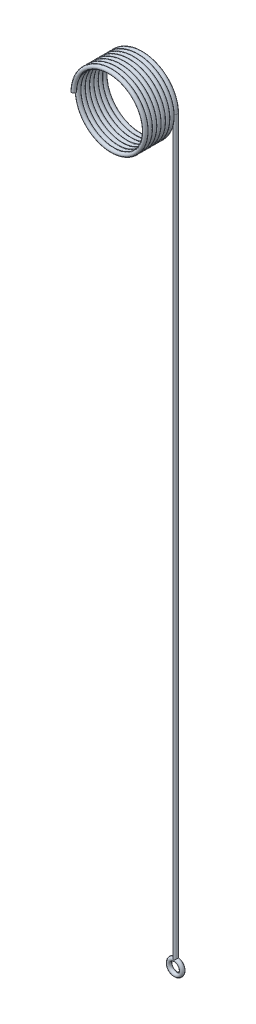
ISO-10303-21;
HEADER;
FILE_DESCRIPTION(('STEP AP214'),'2;1');
FILE_NAME('part.step','',(''),(''),'','','');
FILE_SCHEMA(('AUTOMOTIVE_DESIGN { 1 0 10303 214 1 1 1 1 }'));
ENDSEC;
DATA;
#1=APPLICATION_CONTEXT('core data for automotive mechanical design processes');
#2=APPLICATION_PROTOCOL_DEFINITION('international standard','automotive_design',2000,#1);
#3=PRODUCT_CONTEXT('',#1,'mechanical');
#4=PRODUCT('Part','Part','',(#3));
#5=PRODUCT_RELATED_PRODUCT_CATEGORY('part','',(#4));
#6=PRODUCT_DEFINITION_FORMATION('','',#4);
#7=PRODUCT_DEFINITION_CONTEXT('part definition',#1,'design');
#8=PRODUCT_DEFINITION('design','',#6,#7);
#9=PRODUCT_DEFINITION_SHAPE('','',#8);
#10=(LENGTH_UNIT() NAMED_UNIT(*) SI_UNIT(.MILLI.,.METRE.));
#11=(NAMED_UNIT(*) PLANE_ANGLE_UNIT() SI_UNIT($,.RADIAN.));
#12=(NAMED_UNIT(*) SI_UNIT($,.STERADIAN.) SOLID_ANGLE_UNIT());
#13=UNCERTAINTY_MEASURE_WITH_UNIT(LENGTH_MEASURE(1.E-05),#10,'distance_accuracy_value','');
#14=(GEOMETRIC_REPRESENTATION_CONTEXT(3) GLOBAL_UNCERTAINTY_ASSIGNED_CONTEXT((#13)) GLOBAL_UNIT_ASSIGNED_CONTEXT((#10,
#11,#12)) REPRESENTATION_CONTEXT('',''));
#15=CARTESIAN_POINT('',(0.,0.,0.));
#16=DIRECTION('',(0.,0.,1.));
#17=DIRECTION('',(1.,0.,0.));
#18=AXIS2_PLACEMENT_3D('',#15,#16,#17);
#19=CARTESIAN_POINT('',(-8.5,0.,-0.500000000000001));
#20=DIRECTION('',(0.,-1.,0.));
#21=DIRECTION('',(0.,0.,-1.));
#22=AXIS2_PLACEMENT_3D('',#19,#20,#21);
#23=PLANE('',#22);
#24=CARTESIAN_POINT('',(-8.5,0.,0.));
#25=DIRECTION('',(0.,1.,0.));
#26=DIRECTION('',(0.,0.,1.));
#27=AXIS2_PLACEMENT_3D('',#24,#25,#26);
#28=CIRCLE('',#27,0.500000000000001);
#29=CARTESIAN_POINT('',(-8.5,0.,0.500000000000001));
#30=VERTEX_POINT('',#29);
#31=EDGE_CURVE('E36',#30,#30,#28,.T.);
#32=ORIENTED_EDGE('',*,*,#31,.F.);
#33=EDGE_LOOP('',(#32));
#34=FACE_BOUND('',#33,.T.);
#35=ADVANCED_FACE('F33',(#34),#23,.T.);
#36=CARTESIAN_POINT('',(-8.5,0.,0.500000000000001));
#37=CARTESIAN_POINT('',(-8.5,3.52081528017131,0.433333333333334));
#38=CARTESIAN_POINT('',(-6.01040764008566,6.01040764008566,0.366666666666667));
#39=CARTESIAN_POINT('',(-3.52081528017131,8.5,0.300000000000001));
#40=CARTESIAN_POINT('',(0.,8.5,0.233333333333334));
#41=CARTESIAN_POINT('',(3.52081528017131,8.5,0.166666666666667));
#42=CARTESIAN_POINT('',(6.01040764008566,6.01040764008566,0.100000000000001));
#43=CARTESIAN_POINT('',(8.5,3.52081528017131,0.0333333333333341));
#44=CARTESIAN_POINT('',(8.5,0.,-0.0333333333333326));
#45=CARTESIAN_POINT('',(8.5,-3.52081528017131,-0.0999999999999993));
#46=CARTESIAN_POINT('',(6.01040764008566,-6.01040764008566,-0.166666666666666));
#47=CARTESIAN_POINT('',(3.52081528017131,-8.5,-0.233333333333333));
#48=CARTESIAN_POINT('',(0.,-8.5,-0.299999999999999));
#49=CARTESIAN_POINT('',(-3.52081528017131,-8.5,-0.366666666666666));
#50=CARTESIAN_POINT('',(-6.01040764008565,-6.01040764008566,-0.433333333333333));
#51=CARTESIAN_POINT('',(-8.5,-3.52081528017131,-0.499999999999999));
#52=CARTESIAN_POINT('',(-8.5,0.,-0.566666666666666));
#53=CARTESIAN_POINT('',(-8.5,3.52081528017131,-0.633333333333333));
#54=CARTESIAN_POINT('',(-6.01040764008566,6.01040764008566,-0.699999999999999));
#55=CARTESIAN_POINT('',(-3.52081528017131,8.5,-0.766666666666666));
#56=CARTESIAN_POINT('',(0.,8.5,-0.833333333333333));
#57=CARTESIAN_POINT('',(3.52081528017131,8.5,-0.899999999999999));
#58=CARTESIAN_POINT('',(6.01040764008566,6.01040764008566,-0.966666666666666));
#59=CARTESIAN_POINT('',(8.5,3.52081528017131,-1.03333333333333));
#60=CARTESIAN_POINT('',(8.5,0.,-1.1));
#61=CARTESIAN_POINT('',(8.5,-3.52081528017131,-1.16666666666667));
#62=CARTESIAN_POINT('',(6.01040764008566,-6.01040764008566,-1.23333333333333));
#63=CARTESIAN_POINT('',(3.52081528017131,-8.5,-1.3));
#64=CARTESIAN_POINT('',(0.,-8.5,-1.36666666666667));
#65=CARTESIAN_POINT('',(-3.52081528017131,-8.5,-1.43333333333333));
#66=CARTESIAN_POINT('',(-6.01040764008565,-6.01040764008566,-1.5));
#67=CARTESIAN_POINT('',(-8.5,-3.52081528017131,-1.56666666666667));
#68=CARTESIAN_POINT('',(-8.5,0.,-1.63333333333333));
#69=CARTESIAN_POINT('',(-8.5,3.52081528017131,-1.7));
#70=CARTESIAN_POINT('',(-6.01040764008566,6.01040764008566,-1.76666666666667));
#71=CARTESIAN_POINT('',(-3.52081528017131,8.5,-1.83333333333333));
#72=CARTESIAN_POINT('',(0.,8.5,-1.9));
#73=CARTESIAN_POINT('',(3.52081528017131,8.5,-1.96666666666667));
#74=CARTESIAN_POINT('',(6.01040764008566,6.01040764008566,-2.03333333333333));
#75=CARTESIAN_POINT('',(8.5,3.52081528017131,-2.1));
#76=CARTESIAN_POINT('',(8.5,0.,-2.16666666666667));
#77=CARTESIAN_POINT('',(8.5,-3.52081528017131,-2.23333333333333));
#78=CARTESIAN_POINT('',(6.01040764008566,-6.01040764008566,-2.3));
#79=CARTESIAN_POINT('',(3.52081528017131,-8.5,-2.36666666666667));
#80=CARTESIAN_POINT('',(0.,-8.5,-2.43333333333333));
#81=CARTESIAN_POINT('',(-3.52081528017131,-8.5,-2.5));
#82=CARTESIAN_POINT('',(-6.01040764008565,-6.01040764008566,-2.56666666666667));
#83=CARTESIAN_POINT('',(-8.5,-3.52081528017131,-2.63333333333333));
#84=CARTESIAN_POINT('',(-8.5,0.,-2.7));
#85=CARTESIAN_POINT('',(-8.5,3.52081528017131,-2.76666666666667));
#86=CARTESIAN_POINT('',(-6.01040764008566,6.01040764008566,-2.83333333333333));
#87=CARTESIAN_POINT('',(-3.52081528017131,8.5,-2.9));
#88=CARTESIAN_POINT('',(0.,8.5,-2.96666666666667));
#89=CARTESIAN_POINT('',(3.52081528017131,8.5,-3.03333333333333));
#90=CARTESIAN_POINT('',(6.01040764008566,6.01040764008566,-3.1));
#91=CARTESIAN_POINT('',(8.5,3.52081528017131,-3.16666666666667));
#92=CARTESIAN_POINT('',(8.5,0.,-3.23333333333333));
#93=CARTESIAN_POINT('',(8.5,-3.52081528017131,-3.3));
#94=CARTESIAN_POINT('',(6.01040764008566,-6.01040764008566,-3.36666666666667));
#95=CARTESIAN_POINT('',(3.52081528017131,-8.5,-3.43333333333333));
#96=CARTESIAN_POINT('',(0.,-8.5,-3.5));
#97=CARTESIAN_POINT('',(-3.52081528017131,-8.5,-3.56666666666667));
#98=CARTESIAN_POINT('',(-6.01040764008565,-6.01040764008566,-3.63333333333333));
#99=CARTESIAN_POINT('',(-8.5,-3.52081528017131,-3.7));
#100=CARTESIAN_POINT('',(-8.5,0.,-3.76666666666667));
#101=CARTESIAN_POINT('',(-8.5,3.52081528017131,-3.83333333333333));
#102=CARTESIAN_POINT('',(-6.01040764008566,6.01040764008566,-3.9));
#103=CARTESIAN_POINT('',(-3.52081528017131,8.5,-3.96666666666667));
#104=CARTESIAN_POINT('',(0.,8.5,-4.03333333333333));
#105=CARTESIAN_POINT('',(3.52081528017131,8.5,-4.1));
#106=CARTESIAN_POINT('',(6.01040764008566,6.01040764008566,-4.16666666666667));
#107=CARTESIAN_POINT('',(8.5,3.52081528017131,-4.23333333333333));
#108=CARTESIAN_POINT('',(8.5,0.,-4.3));
#109=CARTESIAN_POINT('',(8.5,-3.52081528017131,-4.36666666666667));
#110=CARTESIAN_POINT('',(6.01040764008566,-6.01040764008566,-4.43333333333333));
#111=CARTESIAN_POINT('',(3.52081528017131,-8.5,-4.5));
#112=CARTESIAN_POINT('',(0.,-8.5,-4.56666666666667));
#113=CARTESIAN_POINT('',(-3.52081528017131,-8.5,-4.63333333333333));
#114=CARTESIAN_POINT('',(-6.01040764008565,-6.01040764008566,-4.7));
#115=CARTESIAN_POINT('',(-8.5,-3.52081528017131,-4.76666666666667));
#116=CARTESIAN_POINT('',(-8.5,0.,-4.83333333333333));
#117=CARTESIAN_POINT('',(-8.5,3.52081528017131,-4.9));
#118=CARTESIAN_POINT('',(-6.01040764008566,6.01040764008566,-4.96666666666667));
#119=CARTESIAN_POINT('',(-3.52081528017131,8.5,-5.03333333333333));
#120=CARTESIAN_POINT('',(0.,8.5,-5.1));
#121=CARTESIAN_POINT('',(3.52081528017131,8.5,-5.16666666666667));
#122=CARTESIAN_POINT('',(6.01040764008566,6.01040764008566,-5.23333333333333));
#123=CARTESIAN_POINT('',(8.5,3.52081528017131,-5.3));
#124=CARTESIAN_POINT('',(8.5,0.,-5.36666666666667));
#125=CARTESIAN_POINT('',(8.5,-3.52081528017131,-5.43333333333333));
#126=CARTESIAN_POINT('',(6.01040764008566,-6.01040764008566,-5.5));
#127=CARTESIAN_POINT('',(3.52081528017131,-8.5,-5.56666666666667));
#128=CARTESIAN_POINT('',(0.,-8.5,-5.63333333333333));
#129=CARTESIAN_POINT('',(-3.52081528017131,-8.5,-5.7));
#130=CARTESIAN_POINT('',(-6.01040764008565,-6.01040764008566,-5.76666666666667));
#131=CARTESIAN_POINT('',(-8.5,-3.52081528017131,-5.83333333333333));
#132=CARTESIAN_POINT('',(-8.5,0.,-5.9));
#133=CARTESIAN_POINT('',(-8.5,3.52081528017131,-5.96666666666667));
#134=CARTESIAN_POINT('',(-6.01040764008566,6.01040764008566,-6.03333333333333));
#135=CARTESIAN_POINT('',(-3.52081528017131,8.5,-6.1));
#136=CARTESIAN_POINT('',(0.,8.5,-6.16666666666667));
#137=CARTESIAN_POINT('',(3.52081528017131,8.5,-6.23333333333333));
#138=CARTESIAN_POINT('',(6.01040764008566,6.01040764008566,-6.3));
#139=CARTESIAN_POINT('',(8.5,3.52081528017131,-6.36666666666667));
#140=CARTESIAN_POINT('',(8.5,0.,-6.43333333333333));
#141=CARTESIAN_POINT('',(8.5,-3.52081528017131,-6.5));
#142=CARTESIAN_POINT('',(6.01040764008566,-6.01040764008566,-6.56666666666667));
#143=CARTESIAN_POINT('',(3.52081528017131,-8.5,-6.63333333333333));
#144=CARTESIAN_POINT('',(0.,-8.5,-6.7));
#145=CARTESIAN_POINT('',(-3.52081528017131,-8.5,-6.76666666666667));
#146=CARTESIAN_POINT('',(-6.01040764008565,-6.01040764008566,-6.83333333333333));
#147=CARTESIAN_POINT('',(-8.5,-3.52081528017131,-6.9));
#148=CARTESIAN_POINT('',(-8.5,0.,-6.96666666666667));
#149=CARTESIAN_POINT('',(-8.5,3.52081528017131,-7.03333333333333));
#150=CARTESIAN_POINT('',(-6.01040764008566,6.01040764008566,-7.1));
#151=CARTESIAN_POINT('',(-3.52081528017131,8.5,-7.16666666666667));
#152=CARTESIAN_POINT('',(0.,8.5,-7.23333333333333));
#153=CARTESIAN_POINT('',(3.52081528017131,8.5,-7.3));
#154=CARTESIAN_POINT('',(6.01040764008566,6.01040764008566,-7.36666666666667));
#155=CARTESIAN_POINT('',(8.5,3.52081528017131,-7.43333333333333));
#156=CARTESIAN_POINT('',(8.5,0.,-7.5));
#157=CARTESIAN_POINT('',(-7.5,0.,0.500000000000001));
#158=CARTESIAN_POINT('',(-7.5,3.10660171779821,0.433333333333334));
#159=CARTESIAN_POINT('',(-5.30330085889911,5.30330085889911,0.366666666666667));
#160=CARTESIAN_POINT('',(-3.10660171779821,7.5,0.300000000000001));
#161=CARTESIAN_POINT('',(0.,7.5,0.233333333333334));
#162=CARTESIAN_POINT('',(3.10660171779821,7.5,0.166666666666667));
#163=CARTESIAN_POINT('',(5.30330085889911,5.30330085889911,0.100000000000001));
#164=CARTESIAN_POINT('',(7.5,3.10660171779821,0.0333333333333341));
#165=CARTESIAN_POINT('',(7.5,0.,-0.0333333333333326));
#166=CARTESIAN_POINT('',(7.5,-3.10660171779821,-0.0999999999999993));
#167=CARTESIAN_POINT('',(5.30330085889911,-5.30330085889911,-0.166666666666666));
#168=CARTESIAN_POINT('',(3.10660171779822,-7.5,-0.233333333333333));
#169=CARTESIAN_POINT('',(0.,-7.5,-0.299999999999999));
#170=CARTESIAN_POINT('',(-3.10660171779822,-7.5,-0.366666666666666));
#171=CARTESIAN_POINT('',(-5.30330085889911,-5.30330085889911,-0.433333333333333));
#172=CARTESIAN_POINT('',(-7.5,-3.10660171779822,-0.499999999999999));
#173=CARTESIAN_POINT('',(-7.5,0.,-0.566666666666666));
#174=CARTESIAN_POINT('',(-7.5,3.10660171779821,-0.633333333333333));
#175=CARTESIAN_POINT('',(-5.30330085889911,5.30330085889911,-0.699999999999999));
#176=CARTESIAN_POINT('',(-3.10660171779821,7.5,-0.766666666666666));
#177=CARTESIAN_POINT('',(0.,7.5,-0.833333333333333));
#178=CARTESIAN_POINT('',(3.10660171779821,7.5,-0.899999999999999));
#179=CARTESIAN_POINT('',(5.30330085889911,5.30330085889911,-0.966666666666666));
#180=CARTESIAN_POINT('',(7.5,3.10660171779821,-1.03333333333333));
#181=CARTESIAN_POINT('',(7.5,0.,-1.1));
#182=CARTESIAN_POINT('',(7.5,-3.10660171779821,-1.16666666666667));
#183=CARTESIAN_POINT('',(5.30330085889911,-5.30330085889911,-1.23333333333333));
#184=CARTESIAN_POINT('',(3.10660171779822,-7.5,-1.3));
#185=CARTESIAN_POINT('',(0.,-7.5,-1.36666666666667));
#186=CARTESIAN_POINT('',(-3.10660171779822,-7.5,-1.43333333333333));
#187=CARTESIAN_POINT('',(-5.30330085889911,-5.30330085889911,-1.5));
#188=CARTESIAN_POINT('',(-7.5,-3.10660171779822,-1.56666666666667));
#189=CARTESIAN_POINT('',(-7.5,0.,-1.63333333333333));
#190=CARTESIAN_POINT('',(-7.5,3.10660171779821,-1.7));
#191=CARTESIAN_POINT('',(-5.30330085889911,5.30330085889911,-1.76666666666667));
#192=CARTESIAN_POINT('',(-3.10660171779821,7.5,-1.83333333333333));
#193=CARTESIAN_POINT('',(0.,7.5,-1.9));
#194=CARTESIAN_POINT('',(3.10660171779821,7.5,-1.96666666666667));
#195=CARTESIAN_POINT('',(5.30330085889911,5.30330085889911,-2.03333333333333));
#196=CARTESIAN_POINT('',(7.5,3.10660171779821,-2.1));
#197=CARTESIAN_POINT('',(7.5,0.,-2.16666666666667));
#198=CARTESIAN_POINT('',(7.5,-3.10660171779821,-2.23333333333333));
#199=CARTESIAN_POINT('',(5.30330085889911,-5.30330085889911,-2.3));
#200=CARTESIAN_POINT('',(3.10660171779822,-7.5,-2.36666666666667));
#201=CARTESIAN_POINT('',(0.,-7.5,-2.43333333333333));
#202=CARTESIAN_POINT('',(-3.10660171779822,-7.5,-2.5));
#203=CARTESIAN_POINT('',(-5.30330085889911,-5.30330085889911,-2.56666666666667));
#204=CARTESIAN_POINT('',(-7.5,-3.10660171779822,-2.63333333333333));
#205=CARTESIAN_POINT('',(-7.5,0.,-2.7));
#206=CARTESIAN_POINT('',(-7.5,3.10660171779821,-2.76666666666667));
#207=CARTESIAN_POINT('',(-5.30330085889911,5.30330085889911,-2.83333333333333));
#208=CARTESIAN_POINT('',(-3.10660171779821,7.5,-2.9));
#209=CARTESIAN_POINT('',(0.,7.5,-2.96666666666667));
#210=CARTESIAN_POINT('',(3.10660171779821,7.5,-3.03333333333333));
#211=CARTESIAN_POINT('',(5.30330085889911,5.30330085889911,-3.1));
#212=CARTESIAN_POINT('',(7.5,3.10660171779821,-3.16666666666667));
#213=CARTESIAN_POINT('',(7.5,0.,-3.23333333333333));
#214=CARTESIAN_POINT('',(7.5,-3.10660171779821,-3.3));
#215=CARTESIAN_POINT('',(5.30330085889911,-5.30330085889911,-3.36666666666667));
#216=CARTESIAN_POINT('',(3.10660171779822,-7.5,-3.43333333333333));
#217=CARTESIAN_POINT('',(0.,-7.5,-3.5));
#218=CARTESIAN_POINT('',(-3.10660171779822,-7.5,-3.56666666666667));
#219=CARTESIAN_POINT('',(-5.30330085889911,-5.30330085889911,-3.63333333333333));
#220=CARTESIAN_POINT('',(-7.5,-3.10660171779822,-3.7));
#221=CARTESIAN_POINT('',(-7.5,0.,-3.76666666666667));
#222=CARTESIAN_POINT('',(-7.5,3.10660171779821,-3.83333333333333));
#223=CARTESIAN_POINT('',(-5.30330085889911,5.30330085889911,-3.9));
#224=CARTESIAN_POINT('',(-3.10660171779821,7.5,-3.96666666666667));
#225=CARTESIAN_POINT('',(0.,7.5,-4.03333333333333));
#226=CARTESIAN_POINT('',(3.10660171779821,7.5,-4.1));
#227=CARTESIAN_POINT('',(5.30330085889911,5.30330085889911,-4.16666666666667));
#228=CARTESIAN_POINT('',(7.5,3.10660171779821,-4.23333333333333));
#229=CARTESIAN_POINT('',(7.5,0.,-4.3));
#230=CARTESIAN_POINT('',(7.5,-3.10660171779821,-4.36666666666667));
#231=CARTESIAN_POINT('',(5.30330085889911,-5.30330085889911,-4.43333333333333));
#232=CARTESIAN_POINT('',(3.10660171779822,-7.5,-4.5));
#233=CARTESIAN_POINT('',(0.,-7.5,-4.56666666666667));
#234=CARTESIAN_POINT('',(-3.10660171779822,-7.5,-4.63333333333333));
#235=CARTESIAN_POINT('',(-5.30330085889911,-5.30330085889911,-4.7));
#236=CARTESIAN_POINT('',(-7.5,-3.10660171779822,-4.76666666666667));
#237=CARTESIAN_POINT('',(-7.5,0.,-4.83333333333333));
#238=CARTESIAN_POINT('',(-7.5,3.10660171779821,-4.9));
#239=CARTESIAN_POINT('',(-5.30330085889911,5.30330085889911,-4.96666666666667));
#240=CARTESIAN_POINT('',(-3.10660171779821,7.5,-5.03333333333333));
#241=CARTESIAN_POINT('',(0.,7.5,-5.1));
#242=CARTESIAN_POINT('',(3.10660171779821,7.5,-5.16666666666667));
#243=CARTESIAN_POINT('',(5.30330085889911,5.30330085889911,-5.23333333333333));
#244=CARTESIAN_POINT('',(7.5,3.10660171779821,-5.3));
#245=CARTESIAN_POINT('',(7.5,0.,-5.36666666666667));
#246=CARTESIAN_POINT('',(7.5,-3.10660171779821,-5.43333333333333));
#247=CARTESIAN_POINT('',(5.30330085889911,-5.30330085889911,-5.5));
#248=CARTESIAN_POINT('',(3.10660171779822,-7.5,-5.56666666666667));
#249=CARTESIAN_POINT('',(0.,-7.5,-5.63333333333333));
#250=CARTESIAN_POINT('',(-3.10660171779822,-7.5,-5.7));
#251=CARTESIAN_POINT('',(-5.30330085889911,-5.30330085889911,-5.76666666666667));
#252=CARTESIAN_POINT('',(-7.5,-3.10660171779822,-5.83333333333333));
#253=CARTESIAN_POINT('',(-7.5,0.,-5.9));
#254=CARTESIAN_POINT('',(-7.5,3.10660171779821,-5.96666666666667));
#255=CARTESIAN_POINT('',(-5.30330085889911,5.30330085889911,-6.03333333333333));
#256=CARTESIAN_POINT('',(-3.10660171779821,7.5,-6.1));
#257=CARTESIAN_POINT('',(0.,7.5,-6.16666666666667));
#258=CARTESIAN_POINT('',(3.10660171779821,7.5,-6.23333333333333));
#259=CARTESIAN_POINT('',(5.30330085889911,5.30330085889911,-6.3));
#260=CARTESIAN_POINT('',(7.5,3.10660171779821,-6.36666666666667));
#261=CARTESIAN_POINT('',(7.5,0.,-6.43333333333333));
#262=CARTESIAN_POINT('',(7.5,-3.10660171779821,-6.5));
#263=CARTESIAN_POINT('',(5.30330085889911,-5.30330085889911,-6.56666666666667));
#264=CARTESIAN_POINT('',(3.10660171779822,-7.5,-6.63333333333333));
#265=CARTESIAN_POINT('',(0.,-7.5,-6.7));
#266=CARTESIAN_POINT('',(-3.10660171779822,-7.5,-6.76666666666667));
#267=CARTESIAN_POINT('',(-5.30330085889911,-5.30330085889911,-6.83333333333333));
#268=CARTESIAN_POINT('',(-7.5,-3.10660171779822,-6.9));
#269=CARTESIAN_POINT('',(-7.5,0.,-6.96666666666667));
#270=CARTESIAN_POINT('',(-7.5,3.10660171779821,-7.03333333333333));
#271=CARTESIAN_POINT('',(-5.30330085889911,5.30330085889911,-7.1));
#272=CARTESIAN_POINT('',(-3.10660171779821,7.5,-7.16666666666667));
#273=CARTESIAN_POINT('',(0.,7.5,-7.23333333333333));
#274=CARTESIAN_POINT('',(3.10660171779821,7.5,-7.3));
#275=CARTESIAN_POINT('',(5.30330085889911,5.30330085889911,-7.36666666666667));
#276=CARTESIAN_POINT('',(7.5,3.10660171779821,-7.43333333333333));
#277=CARTESIAN_POINT('',(7.5,0.,-7.5));
#278=CARTESIAN_POINT('',(-7.5,0.,-0.500000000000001));
#279=CARTESIAN_POINT('',(-7.5,3.10660171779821,-0.566666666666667));
#280=CARTESIAN_POINT('',(-5.30330085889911,5.30330085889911,-0.633333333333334));
#281=CARTESIAN_POINT('',(-3.10660171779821,7.5,-0.700000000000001));
#282=CARTESIAN_POINT('',(0.,7.5,-0.766666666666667));
#283=CARTESIAN_POINT('',(3.10660171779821,7.5,-0.833333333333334));
#284=CARTESIAN_POINT('',(5.30330085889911,5.30330085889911,-0.900000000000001));
#285=CARTESIAN_POINT('',(7.5,3.10660171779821,-0.966666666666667));
#286=CARTESIAN_POINT('',(7.5,0.,-1.03333333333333));
#287=CARTESIAN_POINT('',(7.5,-3.10660171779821,-1.1));
#288=CARTESIAN_POINT('',(5.30330085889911,-5.30330085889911,-1.16666666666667));
#289=CARTESIAN_POINT('',(3.10660171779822,-7.5,-1.23333333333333));
#290=CARTESIAN_POINT('',(0.,-7.5,-1.3));
#291=CARTESIAN_POINT('',(-3.10660171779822,-7.5,-1.36666666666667));
#292=CARTESIAN_POINT('',(-5.30330085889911,-5.30330085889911,-1.43333333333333));
#293=CARTESIAN_POINT('',(-7.5,-3.10660171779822,-1.5));
#294=CARTESIAN_POINT('',(-7.5,0.,-1.56666666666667));
#295=CARTESIAN_POINT('',(-7.5,3.10660171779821,-1.63333333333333));
#296=CARTESIAN_POINT('',(-5.30330085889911,5.30330085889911,-1.7));
#297=CARTESIAN_POINT('',(-3.10660171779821,7.5,-1.76666666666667));
#298=CARTESIAN_POINT('',(0.,7.5,-1.83333333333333));
#299=CARTESIAN_POINT('',(3.10660171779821,7.5,-1.9));
#300=CARTESIAN_POINT('',(5.30330085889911,5.30330085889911,-1.96666666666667));
#301=CARTESIAN_POINT('',(7.5,3.10660171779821,-2.03333333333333));
#302=CARTESIAN_POINT('',(7.5,0.,-2.1));
#303=CARTESIAN_POINT('',(7.5,-3.10660171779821,-2.16666666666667));
#304=CARTESIAN_POINT('',(5.30330085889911,-5.30330085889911,-2.23333333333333));
#305=CARTESIAN_POINT('',(3.10660171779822,-7.5,-2.3));
#306=CARTESIAN_POINT('',(0.,-7.5,-2.36666666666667));
#307=CARTESIAN_POINT('',(-3.10660171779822,-7.5,-2.43333333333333));
#308=CARTESIAN_POINT('',(-5.30330085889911,-5.30330085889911,-2.5));
#309=CARTESIAN_POINT('',(-7.5,-3.10660171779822,-2.56666666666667));
#310=CARTESIAN_POINT('',(-7.5,0.,-2.63333333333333));
#311=CARTESIAN_POINT('',(-7.5,3.10660171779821,-2.7));
#312=CARTESIAN_POINT('',(-5.30330085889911,5.30330085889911,-2.76666666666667));
#313=CARTESIAN_POINT('',(-3.10660171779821,7.5,-2.83333333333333));
#314=CARTESIAN_POINT('',(0.,7.5,-2.9));
#315=CARTESIAN_POINT('',(3.10660171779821,7.5,-2.96666666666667));
#316=CARTESIAN_POINT('',(5.30330085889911,5.30330085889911,-3.03333333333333));
#317=CARTESIAN_POINT('',(7.5,3.10660171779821,-3.1));
#318=CARTESIAN_POINT('',(7.5,0.,-3.16666666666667));
#319=CARTESIAN_POINT('',(7.5,-3.10660171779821,-3.23333333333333));
#320=CARTESIAN_POINT('',(5.30330085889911,-5.30330085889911,-3.3));
#321=CARTESIAN_POINT('',(3.10660171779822,-7.5,-3.36666666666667));
#322=CARTESIAN_POINT('',(0.,-7.5,-3.43333333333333));
#323=CARTESIAN_POINT('',(-3.10660171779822,-7.5,-3.5));
#324=CARTESIAN_POINT('',(-5.30330085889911,-5.30330085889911,-3.56666666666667));
#325=CARTESIAN_POINT('',(-7.5,-3.10660171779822,-3.63333333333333));
#326=CARTESIAN_POINT('',(-7.5,0.,-3.7));
#327=CARTESIAN_POINT('',(-7.5,3.10660171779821,-3.76666666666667));
#328=CARTESIAN_POINT('',(-5.30330085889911,5.30330085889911,-3.83333333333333));
#329=CARTESIAN_POINT('',(-3.10660171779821,7.5,-3.9));
#330=CARTESIAN_POINT('',(0.,7.5,-3.96666666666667));
#331=CARTESIAN_POINT('',(3.10660171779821,7.5,-4.03333333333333));
#332=CARTESIAN_POINT('',(5.30330085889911,5.30330085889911,-4.1));
#333=CARTESIAN_POINT('',(7.5,3.10660171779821,-4.16666666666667));
#334=CARTESIAN_POINT('',(7.5,0.,-4.23333333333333));
#335=CARTESIAN_POINT('',(7.5,-3.10660171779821,-4.3));
#336=CARTESIAN_POINT('',(5.30330085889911,-5.30330085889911,-4.36666666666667));
#337=CARTESIAN_POINT('',(3.10660171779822,-7.5,-4.43333333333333));
#338=CARTESIAN_POINT('',(0.,-7.5,-4.5));
#339=CARTESIAN_POINT('',(-3.10660171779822,-7.5,-4.56666666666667));
#340=CARTESIAN_POINT('',(-5.30330085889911,-5.30330085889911,-4.63333333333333));
#341=CARTESIAN_POINT('',(-7.5,-3.10660171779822,-4.7));
#342=CARTESIAN_POINT('',(-7.5,0.,-4.76666666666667));
#343=CARTESIAN_POINT('',(-7.5,3.10660171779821,-4.83333333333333));
#344=CARTESIAN_POINT('',(-5.30330085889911,5.30330085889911,-4.9));
#345=CARTESIAN_POINT('',(-3.10660171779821,7.5,-4.96666666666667));
#346=CARTESIAN_POINT('',(0.,7.5,-5.03333333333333));
#347=CARTESIAN_POINT('',(3.10660171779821,7.5,-5.1));
#348=CARTESIAN_POINT('',(5.30330085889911,5.30330085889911,-5.16666666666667));
#349=CARTESIAN_POINT('',(7.5,3.10660171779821,-5.23333333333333));
#350=CARTESIAN_POINT('',(7.5,0.,-5.3));
#351=CARTESIAN_POINT('',(7.5,-3.10660171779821,-5.36666666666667));
#352=CARTESIAN_POINT('',(5.30330085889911,-5.30330085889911,-5.43333333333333));
#353=CARTESIAN_POINT('',(3.10660171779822,-7.5,-5.5));
#354=CARTESIAN_POINT('',(0.,-7.5,-5.56666666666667));
#355=CARTESIAN_POINT('',(-3.10660171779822,-7.5,-5.63333333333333));
#356=CARTESIAN_POINT('',(-5.30330085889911,-5.30330085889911,-5.7));
#357=CARTESIAN_POINT('',(-7.5,-3.10660171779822,-5.76666666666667));
#358=CARTESIAN_POINT('',(-7.5,0.,-5.83333333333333));
#359=CARTESIAN_POINT('',(-7.5,3.10660171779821,-5.9));
#360=CARTESIAN_POINT('',(-5.30330085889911,5.30330085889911,-5.96666666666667));
#361=CARTESIAN_POINT('',(-3.10660171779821,7.5,-6.03333333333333));
#362=CARTESIAN_POINT('',(0.,7.5,-6.1));
#363=CARTESIAN_POINT('',(3.10660171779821,7.5,-6.16666666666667));
#364=CARTESIAN_POINT('',(5.30330085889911,5.30330085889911,-6.23333333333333));
#365=CARTESIAN_POINT('',(7.5,3.10660171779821,-6.3));
#366=CARTESIAN_POINT('',(7.5,0.,-6.36666666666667));
#367=CARTESIAN_POINT('',(7.5,-3.10660171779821,-6.43333333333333));
#368=CARTESIAN_POINT('',(5.30330085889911,-5.30330085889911,-6.5));
#369=CARTESIAN_POINT('',(3.10660171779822,-7.5,-6.56666666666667));
#370=CARTESIAN_POINT('',(0.,-7.5,-6.63333333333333));
#371=CARTESIAN_POINT('',(-3.10660171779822,-7.5,-6.7));
#372=CARTESIAN_POINT('',(-5.30330085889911,-5.30330085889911,-6.76666666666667));
#373=CARTESIAN_POINT('',(-7.5,-3.10660171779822,-6.83333333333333));
#374=CARTESIAN_POINT('',(-7.5,0.,-6.9));
#375=CARTESIAN_POINT('',(-7.5,3.10660171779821,-6.96666666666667));
#376=CARTESIAN_POINT('',(-5.30330085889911,5.30330085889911,-7.03333333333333));
#377=CARTESIAN_POINT('',(-3.10660171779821,7.5,-7.1));
#378=CARTESIAN_POINT('',(0.,7.5,-7.16666666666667));
#379=CARTESIAN_POINT('',(3.10660171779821,7.5,-7.23333333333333));
#380=CARTESIAN_POINT('',(5.30330085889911,5.30330085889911,-7.3));
#381=CARTESIAN_POINT('',(7.5,3.10660171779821,-7.36666666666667));
#382=CARTESIAN_POINT('',(7.5,0.,-7.43333333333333));
#383=CARTESIAN_POINT('',(7.5,-3.10660171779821,-7.5));
#384=CARTESIAN_POINT('',(5.30330085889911,-5.30330085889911,-7.56666666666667));
#385=CARTESIAN_POINT('',(3.10660171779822,-7.5,-7.63333333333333));
#386=CARTESIAN_POINT('',(0.,-7.5,-7.7));
#387=CARTESIAN_POINT('',(-3.10660171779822,-7.5,-7.76666666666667));
#388=CARTESIAN_POINT('',(-5.30330085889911,-5.30330085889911,-7.83333333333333));
#389=CARTESIAN_POINT('',(-7.5,-3.10660171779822,-7.9));
#390=CARTESIAN_POINT('',(-7.5,0.,-7.96666666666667));
#391=CARTESIAN_POINT('',(-7.5,3.10660171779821,-8.03333333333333));
#392=CARTESIAN_POINT('',(-5.30330085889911,5.30330085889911,-8.1));
#393=CARTESIAN_POINT('',(-3.10660171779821,7.5,-8.16666666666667));
#394=CARTESIAN_POINT('',(0.,7.5,-8.23333333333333));
#395=CARTESIAN_POINT('',(3.10660171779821,7.5,-8.3));
#396=CARTESIAN_POINT('',(5.30330085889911,5.30330085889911,-8.36666666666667));
#397=CARTESIAN_POINT('',(7.5,3.10660171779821,-8.43333333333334));
#398=CARTESIAN_POINT('',(7.5,0.,-8.5));
#399=CARTESIAN_POINT('',(-8.5,0.,-0.500000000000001));
#400=CARTESIAN_POINT('',(-8.5,3.52081528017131,-0.566666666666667));
#401=CARTESIAN_POINT('',(-6.01040764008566,6.01040764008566,-0.633333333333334));
#402=CARTESIAN_POINT('',(-3.52081528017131,8.5,-0.700000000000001));
#403=CARTESIAN_POINT('',(0.,8.5,-0.766666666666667));
#404=CARTESIAN_POINT('',(3.52081528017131,8.5,-0.833333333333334));
#405=CARTESIAN_POINT('',(6.01040764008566,6.01040764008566,-0.900000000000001));
#406=CARTESIAN_POINT('',(8.5,3.52081528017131,-0.966666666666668));
#407=CARTESIAN_POINT('',(8.5,0.,-1.03333333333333));
#408=CARTESIAN_POINT('',(8.5,-3.52081528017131,-1.1));
#409=CARTESIAN_POINT('',(6.01040764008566,-6.01040764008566,-1.16666666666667));
#410=CARTESIAN_POINT('',(3.52081528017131,-8.5,-1.23333333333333));
#411=CARTESIAN_POINT('',(0.,-8.5,-1.3));
#412=CARTESIAN_POINT('',(-3.52081528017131,-8.5,-1.36666666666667));
#413=CARTESIAN_POINT('',(-6.01040764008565,-6.01040764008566,-1.43333333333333));
#414=CARTESIAN_POINT('',(-8.5,-3.52081528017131,-1.5));
#415=CARTESIAN_POINT('',(-8.5,0.,-1.56666666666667));
#416=CARTESIAN_POINT('',(-8.5,3.52081528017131,-1.63333333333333));
#417=CARTESIAN_POINT('',(-6.01040764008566,6.01040764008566,-1.7));
#418=CARTESIAN_POINT('',(-3.52081528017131,8.5,-1.76666666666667));
#419=CARTESIAN_POINT('',(0.,8.5,-1.83333333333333));
#420=CARTESIAN_POINT('',(3.52081528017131,8.5,-1.9));
#421=CARTESIAN_POINT('',(6.01040764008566,6.01040764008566,-1.96666666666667));
#422=CARTESIAN_POINT('',(8.5,3.52081528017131,-2.03333333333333));
#423=CARTESIAN_POINT('',(8.5,0.,-2.1));
#424=CARTESIAN_POINT('',(8.5,-3.52081528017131,-2.16666666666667));
#425=CARTESIAN_POINT('',(6.01040764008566,-6.01040764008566,-2.23333333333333));
#426=CARTESIAN_POINT('',(3.52081528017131,-8.5,-2.3));
#427=CARTESIAN_POINT('',(0.,-8.5,-2.36666666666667));
#428=CARTESIAN_POINT('',(-3.52081528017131,-8.5,-2.43333333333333));
#429=CARTESIAN_POINT('',(-6.01040764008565,-6.01040764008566,-2.5));
#430=CARTESIAN_POINT('',(-8.5,-3.52081528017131,-2.56666666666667));
#431=CARTESIAN_POINT('',(-8.5,0.,-2.63333333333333));
#432=CARTESIAN_POINT('',(-8.5,3.52081528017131,-2.7));
#433=CARTESIAN_POINT('',(-6.01040764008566,6.01040764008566,-2.76666666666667));
#434=CARTESIAN_POINT('',(-3.52081528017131,8.5,-2.83333333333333));
#435=CARTESIAN_POINT('',(0.,8.5,-2.9));
#436=CARTESIAN_POINT('',(3.52081528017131,8.5,-2.96666666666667));
#437=CARTESIAN_POINT('',(6.01040764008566,6.01040764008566,-3.03333333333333));
#438=CARTESIAN_POINT('',(8.5,3.52081528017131,-3.1));
#439=CARTESIAN_POINT('',(8.5,0.,-3.16666666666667));
#440=CARTESIAN_POINT('',(8.5,-3.52081528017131,-3.23333333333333));
#441=CARTESIAN_POINT('',(6.01040764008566,-6.01040764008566,-3.3));
#442=CARTESIAN_POINT('',(3.52081528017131,-8.5,-3.36666666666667));
#443=CARTESIAN_POINT('',(0.,-8.5,-3.43333333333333));
#444=CARTESIAN_POINT('',(-3.52081528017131,-8.5,-3.5));
#445=CARTESIAN_POINT('',(-6.01040764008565,-6.01040764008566,-3.56666666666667));
#446=CARTESIAN_POINT('',(-8.5,-3.52081528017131,-3.63333333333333));
#447=CARTESIAN_POINT('',(-8.5,0.,-3.7));
#448=CARTESIAN_POINT('',(-8.5,3.52081528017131,-3.76666666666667));
#449=CARTESIAN_POINT('',(-6.01040764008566,6.01040764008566,-3.83333333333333));
#450=CARTESIAN_POINT('',(-3.52081528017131,8.5,-3.9));
#451=CARTESIAN_POINT('',(0.,8.5,-3.96666666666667));
#452=CARTESIAN_POINT('',(3.52081528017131,8.5,-4.03333333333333));
#453=CARTESIAN_POINT('',(6.01040764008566,6.01040764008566,-4.1));
#454=CARTESIAN_POINT('',(8.5,3.52081528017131,-4.16666666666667));
#455=CARTESIAN_POINT('',(8.5,0.,-4.23333333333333));
#456=CARTESIAN_POINT('',(8.5,-3.52081528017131,-4.3));
#457=CARTESIAN_POINT('',(6.01040764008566,-6.01040764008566,-4.36666666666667));
#458=CARTESIAN_POINT('',(3.52081528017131,-8.5,-4.43333333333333));
#459=CARTESIAN_POINT('',(0.,-8.5,-4.5));
#460=CARTESIAN_POINT('',(-3.52081528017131,-8.5,-4.56666666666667));
#461=CARTESIAN_POINT('',(-6.01040764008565,-6.01040764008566,-4.63333333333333));
#462=CARTESIAN_POINT('',(-8.5,-3.52081528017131,-4.7));
#463=CARTESIAN_POINT('',(-8.5,0.,-4.76666666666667));
#464=CARTESIAN_POINT('',(-8.5,3.52081528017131,-4.83333333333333));
#465=CARTESIAN_POINT('',(-6.01040764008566,6.01040764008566,-4.9));
#466=CARTESIAN_POINT('',(-3.52081528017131,8.5,-4.96666666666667));
#467=CARTESIAN_POINT('',(0.,8.5,-5.03333333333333));
#468=CARTESIAN_POINT('',(3.52081528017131,8.5,-5.1));
#469=CARTESIAN_POINT('',(6.01040764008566,6.01040764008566,-5.16666666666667));
#470=CARTESIAN_POINT('',(8.5,3.52081528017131,-5.23333333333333));
#471=CARTESIAN_POINT('',(8.5,0.,-5.3));
#472=CARTESIAN_POINT('',(8.5,-3.52081528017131,-5.36666666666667));
#473=CARTESIAN_POINT('',(6.01040764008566,-6.01040764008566,-5.43333333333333));
#474=CARTESIAN_POINT('',(3.52081528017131,-8.5,-5.5));
#475=CARTESIAN_POINT('',(0.,-8.5,-5.56666666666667));
#476=CARTESIAN_POINT('',(-3.52081528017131,-8.5,-5.63333333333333));
#477=CARTESIAN_POINT('',(-6.01040764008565,-6.01040764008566,-5.7));
#478=CARTESIAN_POINT('',(-8.5,-3.52081528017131,-5.76666666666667));
#479=CARTESIAN_POINT('',(-8.5,0.,-5.83333333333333));
#480=CARTESIAN_POINT('',(-8.5,3.52081528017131,-5.9));
#481=CARTESIAN_POINT('',(-6.01040764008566,6.01040764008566,-5.96666666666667));
#482=CARTESIAN_POINT('',(-3.52081528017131,8.5,-6.03333333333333));
#483=CARTESIAN_POINT('',(0.,8.5,-6.1));
#484=CARTESIAN_POINT('',(3.52081528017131,8.5,-6.16666666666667));
#485=CARTESIAN_POINT('',(6.01040764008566,6.01040764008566,-6.23333333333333));
#486=CARTESIAN_POINT('',(8.5,3.52081528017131,-6.3));
#487=CARTESIAN_POINT('',(8.5,0.,-6.36666666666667));
#488=CARTESIAN_POINT('',(8.5,-3.52081528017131,-6.43333333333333));
#489=CARTESIAN_POINT('',(6.01040764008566,-6.01040764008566,-6.5));
#490=CARTESIAN_POINT('',(3.52081528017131,-8.5,-6.56666666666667));
#491=CARTESIAN_POINT('',(0.,-8.5,-6.63333333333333));
#492=CARTESIAN_POINT('',(-3.52081528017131,-8.5,-6.7));
#493=CARTESIAN_POINT('',(-6.01040764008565,-6.01040764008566,-6.76666666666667));
#494=CARTESIAN_POINT('',(-8.5,-3.52081528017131,-6.83333333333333));
#495=CARTESIAN_POINT('',(-8.5,0.,-6.9));
#496=CARTESIAN_POINT('',(-8.5,3.52081528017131,-6.96666666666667));
#497=CARTESIAN_POINT('',(-6.01040764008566,6.01040764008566,-7.03333333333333));
#498=CARTESIAN_POINT('',(-3.52081528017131,8.5,-7.1));
#499=CARTESIAN_POINT('',(0.,8.5,-7.16666666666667));
#500=CARTESIAN_POINT('',(3.52081528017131,8.5,-7.23333333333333));
#501=CARTESIAN_POINT('',(6.01040764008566,6.01040764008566,-7.3));
#502=CARTESIAN_POINT('',(8.5,3.52081528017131,-7.36666666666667));
#503=CARTESIAN_POINT('',(8.5,0.,-7.43333333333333));
#504=CARTESIAN_POINT('',(8.5,-3.52081528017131,-7.5));
#505=CARTESIAN_POINT('',(6.01040764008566,-6.01040764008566,-7.56666666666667));
#506=CARTESIAN_POINT('',(3.52081528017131,-8.5,-7.63333333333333));
#507=CARTESIAN_POINT('',(0.,-8.5,-7.7));
#508=CARTESIAN_POINT('',(-3.52081528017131,-8.5,-7.76666666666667));
#509=CARTESIAN_POINT('',(-6.01040764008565,-6.01040764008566,-7.83333333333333));
#510=CARTESIAN_POINT('',(-8.5,-3.52081528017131,-7.9));
#511=CARTESIAN_POINT('',(-8.5,0.,-7.96666666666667));
#512=CARTESIAN_POINT('',(-8.5,3.52081528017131,-8.03333333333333));
#513=CARTESIAN_POINT('',(-6.01040764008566,6.01040764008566,-8.1));
#514=CARTESIAN_POINT('',(-3.52081528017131,8.5,-8.16666666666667));
#515=CARTESIAN_POINT('',(0.,8.5,-8.23333333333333));
#516=CARTESIAN_POINT('',(3.52081528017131,8.5,-8.3));
#517=CARTESIAN_POINT('',(6.01040764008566,6.01040764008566,-8.36666666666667));
#518=CARTESIAN_POINT('',(8.5,3.52081528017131,-8.43333333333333));
#519=CARTESIAN_POINT('',(8.5,0.,-8.5));
#520=CARTESIAN_POINT('',(-9.5,0.,-0.500000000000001));
#521=CARTESIAN_POINT('',(-9.5,3.9350288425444,-0.566666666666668));
#522=CARTESIAN_POINT('',(-6.7175144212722,6.7175144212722,-0.633333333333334));
#523=CARTESIAN_POINT('',(-3.9350288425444,9.5,-0.700000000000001));
#524=CARTESIAN_POINT('',(0.,9.5,-0.766666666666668));
#525=CARTESIAN_POINT('',(3.9350288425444,9.5,-0.833333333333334));
#526=CARTESIAN_POINT('',(6.7175144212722,6.7175144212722,-0.900000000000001));
#527=CARTESIAN_POINT('',(9.5,3.93502884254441,-0.966666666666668));
#528=CARTESIAN_POINT('',(9.5,0.,-1.03333333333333));
#529=CARTESIAN_POINT('',(9.5,-3.9350288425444,-1.1));
#530=CARTESIAN_POINT('',(6.7175144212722,-6.7175144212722,-1.16666666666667));
#531=CARTESIAN_POINT('',(3.93502884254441,-9.5,-1.23333333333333));
#532=CARTESIAN_POINT('',(0.,-9.5,-1.3));
#533=CARTESIAN_POINT('',(-3.93502884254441,-9.5,-1.36666666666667));
#534=CARTESIAN_POINT('',(-6.7175144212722,-6.7175144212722,-1.43333333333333));
#535=CARTESIAN_POINT('',(-9.5,-3.93502884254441,-1.5));
#536=CARTESIAN_POINT('',(-9.5,0.,-1.56666666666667));
#537=CARTESIAN_POINT('',(-9.5,3.9350288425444,-1.63333333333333));
#538=CARTESIAN_POINT('',(-6.7175144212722,6.7175144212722,-1.7));
#539=CARTESIAN_POINT('',(-3.9350288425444,9.5,-1.76666666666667));
#540=CARTESIAN_POINT('',(0.,9.5,-1.83333333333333));
#541=CARTESIAN_POINT('',(3.9350288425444,9.5,-1.9));
#542=CARTESIAN_POINT('',(6.7175144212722,6.7175144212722,-1.96666666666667));
#543=CARTESIAN_POINT('',(9.5,3.93502884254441,-2.03333333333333));
#544=CARTESIAN_POINT('',(9.5,0.,-2.1));
#545=CARTESIAN_POINT('',(9.5,-3.9350288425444,-2.16666666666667));
#546=CARTESIAN_POINT('',(6.7175144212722,-6.7175144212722,-2.23333333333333));
#547=CARTESIAN_POINT('',(3.93502884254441,-9.5,-2.3));
#548=CARTESIAN_POINT('',(0.,-9.5,-2.36666666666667));
#549=CARTESIAN_POINT('',(-3.93502884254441,-9.5,-2.43333333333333));
#550=CARTESIAN_POINT('',(-6.7175144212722,-6.7175144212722,-2.5));
#551=CARTESIAN_POINT('',(-9.5,-3.93502884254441,-2.56666666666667));
#552=CARTESIAN_POINT('',(-9.5,0.,-2.63333333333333));
#553=CARTESIAN_POINT('',(-9.5,3.9350288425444,-2.7));
#554=CARTESIAN_POINT('',(-6.7175144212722,6.7175144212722,-2.76666666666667));
#555=CARTESIAN_POINT('',(-3.9350288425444,9.5,-2.83333333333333));
#556=CARTESIAN_POINT('',(0.,9.5,-2.9));
#557=CARTESIAN_POINT('',(3.9350288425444,9.5,-2.96666666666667));
#558=CARTESIAN_POINT('',(6.7175144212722,6.7175144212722,-3.03333333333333));
#559=CARTESIAN_POINT('',(9.5,3.93502884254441,-3.1));
#560=CARTESIAN_POINT('',(9.5,0.,-3.16666666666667));
#561=CARTESIAN_POINT('',(9.5,-3.9350288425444,-3.23333333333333));
#562=CARTESIAN_POINT('',(6.7175144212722,-6.7175144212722,-3.3));
#563=CARTESIAN_POINT('',(3.93502884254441,-9.5,-3.36666666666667));
#564=CARTESIAN_POINT('',(0.,-9.5,-3.43333333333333));
#565=CARTESIAN_POINT('',(-3.93502884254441,-9.5,-3.5));
#566=CARTESIAN_POINT('',(-6.7175144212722,-6.7175144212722,-3.56666666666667));
#567=CARTESIAN_POINT('',(-9.5,-3.93502884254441,-3.63333333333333));
#568=CARTESIAN_POINT('',(-9.5,0.,-3.7));
#569=CARTESIAN_POINT('',(-9.5,3.9350288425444,-3.76666666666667));
#570=CARTESIAN_POINT('',(-6.7175144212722,6.7175144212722,-3.83333333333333));
#571=CARTESIAN_POINT('',(-3.9350288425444,9.5,-3.9));
#572=CARTESIAN_POINT('',(0.,9.5,-3.96666666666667));
#573=CARTESIAN_POINT('',(3.9350288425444,9.5,-4.03333333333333));
#574=CARTESIAN_POINT('',(6.7175144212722,6.7175144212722,-4.1));
#575=CARTESIAN_POINT('',(9.5,3.93502884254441,-4.16666666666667));
#576=CARTESIAN_POINT('',(9.5,0.,-4.23333333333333));
#577=CARTESIAN_POINT('',(9.5,-3.9350288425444,-4.3));
#578=CARTESIAN_POINT('',(6.7175144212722,-6.7175144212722,-4.36666666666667));
#579=CARTESIAN_POINT('',(3.93502884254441,-9.5,-4.43333333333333));
#580=CARTESIAN_POINT('',(0.,-9.5,-4.5));
#581=CARTESIAN_POINT('',(-3.93502884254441,-9.5,-4.56666666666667));
#582=CARTESIAN_POINT('',(-6.7175144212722,-6.7175144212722,-4.63333333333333));
#583=CARTESIAN_POINT('',(-9.5,-3.93502884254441,-4.7));
#584=CARTESIAN_POINT('',(-9.5,0.,-4.76666666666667));
#585=CARTESIAN_POINT('',(-9.5,3.9350288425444,-4.83333333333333));
#586=CARTESIAN_POINT('',(-6.7175144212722,6.7175144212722,-4.9));
#587=CARTESIAN_POINT('',(-3.9350288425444,9.5,-4.96666666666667));
#588=CARTESIAN_POINT('',(0.,9.5,-5.03333333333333));
#589=CARTESIAN_POINT('',(3.9350288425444,9.5,-5.1));
#590=CARTESIAN_POINT('',(6.7175144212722,6.7175144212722,-5.16666666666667));
#591=CARTESIAN_POINT('',(9.5,3.93502884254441,-5.23333333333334));
#592=CARTESIAN_POINT('',(9.5,0.,-5.3));
#593=CARTESIAN_POINT('',(9.5,-3.9350288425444,-5.36666666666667));
#594=CARTESIAN_POINT('',(6.7175144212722,-6.7175144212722,-5.43333333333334));
#595=CARTESIAN_POINT('',(3.93502884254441,-9.5,-5.5));
#596=CARTESIAN_POINT('',(0.,-9.5,-5.56666666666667));
#597=CARTESIAN_POINT('',(-3.93502884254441,-9.5,-5.63333333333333));
#598=CARTESIAN_POINT('',(-6.7175144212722,-6.7175144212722,-5.7));
#599=CARTESIAN_POINT('',(-9.5,-3.93502884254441,-5.76666666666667));
#600=CARTESIAN_POINT('',(-9.5,0.,-5.83333333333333));
#601=CARTESIAN_POINT('',(-9.5,3.9350288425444,-5.9));
#602=CARTESIAN_POINT('',(-6.7175144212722,6.7175144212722,-5.96666666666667));
#603=CARTESIAN_POINT('',(-3.9350288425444,9.5,-6.03333333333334));
#604=CARTESIAN_POINT('',(0.,9.5,-6.1));
#605=CARTESIAN_POINT('',(3.9350288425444,9.5,-6.16666666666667));
#606=CARTESIAN_POINT('',(6.7175144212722,6.7175144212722,-6.23333333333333));
#607=CARTESIAN_POINT('',(9.5,3.93502884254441,-6.3));
#608=CARTESIAN_POINT('',(9.5,0.,-6.36666666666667));
#609=CARTESIAN_POINT('',(9.5,-3.9350288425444,-6.43333333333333));
#610=CARTESIAN_POINT('',(6.7175144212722,-6.7175144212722,-6.5));
#611=CARTESIAN_POINT('',(3.93502884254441,-9.5,-6.56666666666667));
#612=CARTESIAN_POINT('',(0.,-9.5,-6.63333333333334));
#613=CARTESIAN_POINT('',(-3.93502884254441,-9.5,-6.7));
#614=CARTESIAN_POINT('',(-6.7175144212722,-6.7175144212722,-6.76666666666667));
#615=CARTESIAN_POINT('',(-9.5,-3.93502884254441,-6.83333333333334));
#616=CARTESIAN_POINT('',(-9.5,0.,-6.9));
#617=CARTESIAN_POINT('',(-9.5,3.9350288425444,-6.96666666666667));
#618=CARTESIAN_POINT('',(-6.7175144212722,6.7175144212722,-7.03333333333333));
#619=CARTESIAN_POINT('',(-3.9350288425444,9.5,-7.1));
#620=CARTESIAN_POINT('',(0.,9.5,-7.16666666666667));
#621=CARTESIAN_POINT('',(3.9350288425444,9.5,-7.23333333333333));
#622=CARTESIAN_POINT('',(6.7175144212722,6.7175144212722,-7.3));
#623=CARTESIAN_POINT('',(9.5,3.93502884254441,-7.36666666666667));
#624=CARTESIAN_POINT('',(9.5,0.,-7.43333333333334));
#625=CARTESIAN_POINT('',(9.5,-3.9350288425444,-7.5));
#626=CARTESIAN_POINT('',(6.7175144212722,-6.7175144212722,-7.56666666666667));
#627=CARTESIAN_POINT('',(3.93502884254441,-9.5,-7.63333333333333));
#628=CARTESIAN_POINT('',(0.,-9.5,-7.7));
#629=CARTESIAN_POINT('',(-3.93502884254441,-9.5,-7.76666666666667));
#630=CARTESIAN_POINT('',(-6.7175144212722,-6.7175144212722,-7.83333333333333));
#631=CARTESIAN_POINT('',(-9.5,-3.93502884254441,-7.9));
#632=CARTESIAN_POINT('',(-9.5,0.,-7.96666666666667));
#633=CARTESIAN_POINT('',(-9.5,3.9350288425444,-8.03333333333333));
#634=CARTESIAN_POINT('',(-6.7175144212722,6.7175144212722,-8.1));
#635=CARTESIAN_POINT('',(-3.9350288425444,9.5,-8.16666666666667));
#636=CARTESIAN_POINT('',(0.,9.5,-8.23333333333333));
#637=CARTESIAN_POINT('',(3.9350288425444,9.5,-8.3));
#638=CARTESIAN_POINT('',(6.7175144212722,6.7175144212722,-8.36666666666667));
#639=CARTESIAN_POINT('',(9.5,3.93502884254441,-8.43333333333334));
#640=CARTESIAN_POINT('',(9.5,0.,-8.5));
#641=CARTESIAN_POINT('',(-9.5,0.,0.500000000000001));
#642=CARTESIAN_POINT('',(-9.5,3.9350288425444,0.433333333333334));
#643=CARTESIAN_POINT('',(-6.7175144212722,6.7175144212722,0.366666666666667));
#644=CARTESIAN_POINT('',(-3.9350288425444,9.5,0.300000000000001));
#645=CARTESIAN_POINT('',(0.,9.5,0.233333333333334));
#646=CARTESIAN_POINT('',(3.9350288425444,9.5,0.166666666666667));
#647=CARTESIAN_POINT('',(6.7175144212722,6.7175144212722,0.100000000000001));
#648=CARTESIAN_POINT('',(9.5,3.93502884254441,0.0333333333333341));
#649=CARTESIAN_POINT('',(9.5,0.,-0.0333333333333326));
#650=CARTESIAN_POINT('',(9.5,-3.9350288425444,-0.0999999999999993));
#651=CARTESIAN_POINT('',(6.7175144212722,-6.7175144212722,-0.166666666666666));
#652=CARTESIAN_POINT('',(3.93502884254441,-9.5,-0.233333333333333));
#653=CARTESIAN_POINT('',(0.,-9.5,-0.299999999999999));
#654=CARTESIAN_POINT('',(-3.93502884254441,-9.5,-0.366666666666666));
#655=CARTESIAN_POINT('',(-6.7175144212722,-6.7175144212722,-0.433333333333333));
#656=CARTESIAN_POINT('',(-9.5,-3.93502884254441,-0.499999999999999));
#657=CARTESIAN_POINT('',(-9.5,0.,-0.566666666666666));
#658=CARTESIAN_POINT('',(-9.5,3.9350288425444,-0.633333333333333));
#659=CARTESIAN_POINT('',(-6.7175144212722,6.7175144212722,-0.699999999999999));
#660=CARTESIAN_POINT('',(-3.9350288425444,9.5,-0.766666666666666));
#661=CARTESIAN_POINT('',(0.,9.5,-0.833333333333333));
#662=CARTESIAN_POINT('',(3.9350288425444,9.5,-0.899999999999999));
#663=CARTESIAN_POINT('',(6.7175144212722,6.7175144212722,-0.966666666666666));
#664=CARTESIAN_POINT('',(9.5,3.93502884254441,-1.03333333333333));
#665=CARTESIAN_POINT('',(9.5,0.,-1.1));
#666=CARTESIAN_POINT('',(9.5,-3.9350288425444,-1.16666666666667));
#667=CARTESIAN_POINT('',(6.7175144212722,-6.7175144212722,-1.23333333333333));
#668=CARTESIAN_POINT('',(3.93502884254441,-9.5,-1.3));
#669=CARTESIAN_POINT('',(0.,-9.5,-1.36666666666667));
#670=CARTESIAN_POINT('',(-3.93502884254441,-9.5,-1.43333333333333));
#671=CARTESIAN_POINT('',(-6.7175144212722,-6.7175144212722,-1.5));
#672=CARTESIAN_POINT('',(-9.5,-3.93502884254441,-1.56666666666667));
#673=CARTESIAN_POINT('',(-9.5,0.,-1.63333333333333));
#674=CARTESIAN_POINT('',(-9.5,3.9350288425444,-1.7));
#675=CARTESIAN_POINT('',(-6.7175144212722,6.7175144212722,-1.76666666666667));
#676=CARTESIAN_POINT('',(-3.9350288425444,9.5,-1.83333333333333));
#677=CARTESIAN_POINT('',(0.,9.5,-1.9));
#678=CARTESIAN_POINT('',(3.9350288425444,9.5,-1.96666666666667));
#679=CARTESIAN_POINT('',(6.7175144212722,6.7175144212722,-2.03333333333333));
#680=CARTESIAN_POINT('',(9.5,3.93502884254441,-2.1));
#681=CARTESIAN_POINT('',(9.5,0.,-2.16666666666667));
#682=CARTESIAN_POINT('',(9.5,-3.9350288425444,-2.23333333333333));
#683=CARTESIAN_POINT('',(6.7175144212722,-6.7175144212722,-2.3));
#684=CARTESIAN_POINT('',(3.93502884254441,-9.5,-2.36666666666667));
#685=CARTESIAN_POINT('',(0.,-9.5,-2.43333333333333));
#686=CARTESIAN_POINT('',(-3.93502884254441,-9.5,-2.5));
#687=CARTESIAN_POINT('',(-6.7175144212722,-6.7175144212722,-2.56666666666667));
#688=CARTESIAN_POINT('',(-9.5,-3.93502884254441,-2.63333333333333));
#689=CARTESIAN_POINT('',(-9.5,0.,-2.7));
#690=CARTESIAN_POINT('',(-9.5,3.9350288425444,-2.76666666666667));
#691=CARTESIAN_POINT('',(-6.7175144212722,6.7175144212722,-2.83333333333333));
#692=CARTESIAN_POINT('',(-3.9350288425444,9.5,-2.9));
#693=CARTESIAN_POINT('',(0.,9.5,-2.96666666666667));
#694=CARTESIAN_POINT('',(3.9350288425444,9.5,-3.03333333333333));
#695=CARTESIAN_POINT('',(6.7175144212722,6.7175144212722,-3.1));
#696=CARTESIAN_POINT('',(9.5,3.93502884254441,-3.16666666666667));
#697=CARTESIAN_POINT('',(9.5,0.,-3.23333333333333));
#698=CARTESIAN_POINT('',(9.5,-3.9350288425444,-3.3));
#699=CARTESIAN_POINT('',(6.7175144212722,-6.7175144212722,-3.36666666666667));
#700=CARTESIAN_POINT('',(3.93502884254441,-9.5,-3.43333333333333));
#701=CARTESIAN_POINT('',(0.,-9.5,-3.5));
#702=CARTESIAN_POINT('',(-3.93502884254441,-9.5,-3.56666666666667));
#703=CARTESIAN_POINT('',(-6.7175144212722,-6.7175144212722,-3.63333333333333));
#704=CARTESIAN_POINT('',(-9.5,-3.93502884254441,-3.7));
#705=CARTESIAN_POINT('',(-9.5,0.,-3.76666666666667));
#706=CARTESIAN_POINT('',(-9.5,3.9350288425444,-3.83333333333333));
#707=CARTESIAN_POINT('',(-6.7175144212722,6.7175144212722,-3.9));
#708=CARTESIAN_POINT('',(-3.9350288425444,9.5,-3.96666666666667));
#709=CARTESIAN_POINT('',(0.,9.5,-4.03333333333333));
#710=CARTESIAN_POINT('',(3.9350288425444,9.5,-4.1));
#711=CARTESIAN_POINT('',(6.7175144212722,6.7175144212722,-4.16666666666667));
#712=CARTESIAN_POINT('',(9.5,3.93502884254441,-4.23333333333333));
#713=CARTESIAN_POINT('',(9.5,0.,-4.3));
#714=CARTESIAN_POINT('',(9.5,-3.9350288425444,-4.36666666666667));
#715=CARTESIAN_POINT('',(6.7175144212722,-6.7175144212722,-4.43333333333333));
#716=CARTESIAN_POINT('',(3.93502884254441,-9.5,-4.5));
#717=CARTESIAN_POINT('',(0.,-9.5,-4.56666666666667));
#718=CARTESIAN_POINT('',(-3.93502884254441,-9.5,-4.63333333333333));
#719=CARTESIAN_POINT('',(-6.7175144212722,-6.7175144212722,-4.7));
#720=CARTESIAN_POINT('',(-9.5,-3.93502884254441,-4.76666666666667));
#721=CARTESIAN_POINT('',(-9.5,0.,-4.83333333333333));
#722=CARTESIAN_POINT('',(-9.5,3.9350288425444,-4.9));
#723=CARTESIAN_POINT('',(-6.7175144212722,6.7175144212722,-4.96666666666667));
#724=CARTESIAN_POINT('',(-3.9350288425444,9.5,-5.03333333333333));
#725=CARTESIAN_POINT('',(0.,9.5,-5.1));
#726=CARTESIAN_POINT('',(3.9350288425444,9.5,-5.16666666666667));
#727=CARTESIAN_POINT('',(6.7175144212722,6.7175144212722,-5.23333333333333));
#728=CARTESIAN_POINT('',(9.5,3.93502884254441,-5.3));
#729=CARTESIAN_POINT('',(9.5,0.,-5.36666666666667));
#730=CARTESIAN_POINT('',(9.5,-3.9350288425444,-5.43333333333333));
#731=CARTESIAN_POINT('',(6.7175144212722,-6.7175144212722,-5.5));
#732=CARTESIAN_POINT('',(3.93502884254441,-9.5,-5.56666666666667));
#733=CARTESIAN_POINT('',(0.,-9.5,-5.63333333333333));
#734=CARTESIAN_POINT('',(-3.93502884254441,-9.5,-5.7));
#735=CARTESIAN_POINT('',(-6.7175144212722,-6.7175144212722,-5.76666666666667));
#736=CARTESIAN_POINT('',(-9.5,-3.93502884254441,-5.83333333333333));
#737=CARTESIAN_POINT('',(-9.5,0.,-5.9));
#738=CARTESIAN_POINT('',(-9.5,3.9350288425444,-5.96666666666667));
#739=CARTESIAN_POINT('',(-6.7175144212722,6.7175144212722,-6.03333333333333));
#740=CARTESIAN_POINT('',(-3.9350288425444,9.5,-6.1));
#741=CARTESIAN_POINT('',(0.,9.5,-6.16666666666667));
#742=CARTESIAN_POINT('',(3.9350288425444,9.5,-6.23333333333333));
#743=CARTESIAN_POINT('',(6.7175144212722,6.7175144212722,-6.3));
#744=CARTESIAN_POINT('',(9.5,3.93502884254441,-6.36666666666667));
#745=CARTESIAN_POINT('',(9.5,0.,-6.43333333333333));
#746=CARTESIAN_POINT('',(9.5,-3.9350288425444,-6.5));
#747=CARTESIAN_POINT('',(6.7175144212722,-6.7175144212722,-6.56666666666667));
#748=CARTESIAN_POINT('',(3.93502884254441,-9.5,-6.63333333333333));
#749=CARTESIAN_POINT('',(0.,-9.5,-6.7));
#750=CARTESIAN_POINT('',(-3.93502884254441,-9.5,-6.76666666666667));
#751=CARTESIAN_POINT('',(-6.7175144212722,-6.7175144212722,-6.83333333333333));
#752=CARTESIAN_POINT('',(-9.5,-3.93502884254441,-6.9));
#753=CARTESIAN_POINT('',(-9.5,0.,-6.96666666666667));
#754=CARTESIAN_POINT('',(-9.5,3.9350288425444,-7.03333333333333));
#755=CARTESIAN_POINT('',(-6.7175144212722,6.7175144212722,-7.1));
#756=CARTESIAN_POINT('',(-3.9350288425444,9.5,-7.16666666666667));
#757=CARTESIAN_POINT('',(0.,9.5,-7.23333333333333));
#758=CARTESIAN_POINT('',(3.9350288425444,9.5,-7.3));
#759=CARTESIAN_POINT('',(6.7175144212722,6.7175144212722,-7.36666666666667));
#760=CARTESIAN_POINT('',(9.5,3.93502884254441,-7.43333333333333));
#761=CARTESIAN_POINT('',(9.5,0.,-7.5));
#762=CARTESIAN_POINT('',(-8.5,0.,0.500000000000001));
#763=CARTESIAN_POINT('',(-8.5,3.52081528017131,0.433333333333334));
#764=CARTESIAN_POINT('',(-6.01040764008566,6.01040764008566,0.366666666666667));
#765=CARTESIAN_POINT('',(-3.52081528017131,8.5,0.300000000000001));
#766=CARTESIAN_POINT('',(0.,8.5,0.233333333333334));
#767=CARTESIAN_POINT('',(3.52081528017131,8.5,0.166666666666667));
#768=CARTESIAN_POINT('',(6.01040764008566,6.01040764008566,0.100000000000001));
#769=CARTESIAN_POINT('',(8.5,3.52081528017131,0.0333333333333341));
#770=CARTESIAN_POINT('',(8.5,0.,-0.0333333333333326));
#771=CARTESIAN_POINT('',(8.5,-3.52081528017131,-0.0999999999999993));
#772=CARTESIAN_POINT('',(6.01040764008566,-6.01040764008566,-0.166666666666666));
#773=CARTESIAN_POINT('',(3.52081528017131,-8.5,-0.233333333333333));
#774=CARTESIAN_POINT('',(0.,-8.5,-0.299999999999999));
#775=CARTESIAN_POINT('',(-3.52081528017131,-8.5,-0.366666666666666));
#776=CARTESIAN_POINT('',(-6.01040764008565,-6.01040764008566,-0.433333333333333));
#777=CARTESIAN_POINT('',(-8.5,-3.52081528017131,-0.499999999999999));
#778=CARTESIAN_POINT('',(-8.5,0.,-0.566666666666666));
#779=CARTESIAN_POINT('',(-8.5,3.52081528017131,-0.633333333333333));
#780=CARTESIAN_POINT('',(-6.01040764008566,6.01040764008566,-0.699999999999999));
#781=CARTESIAN_POINT('',(-3.52081528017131,8.5,-0.766666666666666));
#782=CARTESIAN_POINT('',(0.,8.5,-0.833333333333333));
#783=CARTESIAN_POINT('',(3.52081528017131,8.5,-0.899999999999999));
#784=CARTESIAN_POINT('',(6.01040764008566,6.01040764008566,-0.966666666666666));
#785=CARTESIAN_POINT('',(8.5,3.52081528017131,-1.03333333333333));
#786=CARTESIAN_POINT('',(8.5,0.,-1.1));
#787=CARTESIAN_POINT('',(8.5,-3.52081528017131,-1.16666666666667));
#788=CARTESIAN_POINT('',(6.01040764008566,-6.01040764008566,-1.23333333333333));
#789=CARTESIAN_POINT('',(3.52081528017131,-8.5,-1.3));
#790=CARTESIAN_POINT('',(0.,-8.5,-1.36666666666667));
#791=CARTESIAN_POINT('',(-3.52081528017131,-8.5,-1.43333333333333));
#792=CARTESIAN_POINT('',(-6.01040764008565,-6.01040764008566,-1.5));
#793=CARTESIAN_POINT('',(-8.5,-3.52081528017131,-1.56666666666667));
#794=CARTESIAN_POINT('',(-8.5,0.,-1.63333333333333));
#795=CARTESIAN_POINT('',(-8.5,3.52081528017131,-1.7));
#796=CARTESIAN_POINT('',(-6.01040764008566,6.01040764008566,-1.76666666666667));
#797=CARTESIAN_POINT('',(-3.52081528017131,8.5,-1.83333333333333));
#798=CARTESIAN_POINT('',(0.,8.5,-1.9));
#799=CARTESIAN_POINT('',(3.52081528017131,8.5,-1.96666666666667));
#800=CARTESIAN_POINT('',(6.01040764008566,6.01040764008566,-2.03333333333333));
#801=CARTESIAN_POINT('',(8.5,3.52081528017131,-2.1));
#802=CARTESIAN_POINT('',(8.5,0.,-2.16666666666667));
#803=CARTESIAN_POINT('',(8.5,-3.52081528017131,-2.23333333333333));
#804=CARTESIAN_POINT('',(6.01040764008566,-6.01040764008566,-2.3));
#805=CARTESIAN_POINT('',(3.52081528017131,-8.5,-2.36666666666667));
#806=CARTESIAN_POINT('',(0.,-8.5,-2.43333333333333));
#807=CARTESIAN_POINT('',(-3.52081528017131,-8.5,-2.5));
#808=CARTESIAN_POINT('',(-6.01040764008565,-6.01040764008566,-2.56666666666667));
#809=CARTESIAN_POINT('',(-8.5,-3.52081528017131,-2.63333333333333));
#810=CARTESIAN_POINT('',(-8.5,0.,-2.7));
#811=CARTESIAN_POINT('',(-8.5,3.52081528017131,-2.76666666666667));
#812=CARTESIAN_POINT('',(-6.01040764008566,6.01040764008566,-2.83333333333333));
#813=CARTESIAN_POINT('',(-3.52081528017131,8.5,-2.9));
#814=CARTESIAN_POINT('',(0.,8.5,-2.96666666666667));
#815=CARTESIAN_POINT('',(3.52081528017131,8.5,-3.03333333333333));
#816=CARTESIAN_POINT('',(6.01040764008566,6.01040764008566,-3.1));
#817=CARTESIAN_POINT('',(8.5,3.52081528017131,-3.16666666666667));
#818=CARTESIAN_POINT('',(8.5,0.,-3.23333333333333));
#819=CARTESIAN_POINT('',(8.5,-3.52081528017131,-3.3));
#820=CARTESIAN_POINT('',(6.01040764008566,-6.01040764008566,-3.36666666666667));
#821=CARTESIAN_POINT('',(3.52081528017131,-8.5,-3.43333333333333));
#822=CARTESIAN_POINT('',(0.,-8.5,-3.5));
#823=CARTESIAN_POINT('',(-3.52081528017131,-8.5,-3.56666666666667));
#824=CARTESIAN_POINT('',(-6.01040764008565,-6.01040764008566,-3.63333333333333));
#825=CARTESIAN_POINT('',(-8.5,-3.52081528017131,-3.7));
#826=CARTESIAN_POINT('',(-8.5,0.,-3.76666666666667));
#827=CARTESIAN_POINT('',(-8.5,3.52081528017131,-3.83333333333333));
#828=CARTESIAN_POINT('',(-6.01040764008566,6.01040764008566,-3.9));
#829=CARTESIAN_POINT('',(-3.52081528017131,8.5,-3.96666666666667));
#830=CARTESIAN_POINT('',(0.,8.5,-4.03333333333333));
#831=CARTESIAN_POINT('',(3.52081528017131,8.5,-4.1));
#832=CARTESIAN_POINT('',(6.01040764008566,6.01040764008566,-4.16666666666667));
#833=CARTESIAN_POINT('',(8.5,3.52081528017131,-4.23333333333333));
#834=CARTESIAN_POINT('',(8.5,0.,-4.3));
#835=CARTESIAN_POINT('',(8.5,-3.52081528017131,-4.36666666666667));
#836=CARTESIAN_POINT('',(6.01040764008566,-6.01040764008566,-4.43333333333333));
#837=CARTESIAN_POINT('',(3.52081528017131,-8.5,-4.5));
#838=CARTESIAN_POINT('',(0.,-8.5,-4.56666666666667));
#839=CARTESIAN_POINT('',(-3.52081528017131,-8.5,-4.63333333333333));
#840=CARTESIAN_POINT('',(-6.01040764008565,-6.01040764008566,-4.7));
#841=CARTESIAN_POINT('',(-8.5,-3.52081528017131,-4.76666666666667));
#842=CARTESIAN_POINT('',(-8.5,0.,-4.83333333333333));
#843=CARTESIAN_POINT('',(-8.5,3.52081528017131,-4.9));
#844=CARTESIAN_POINT('',(-6.01040764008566,6.01040764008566,-4.96666666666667));
#845=CARTESIAN_POINT('',(-3.52081528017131,8.5,-5.03333333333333));
#846=CARTESIAN_POINT('',(0.,8.5,-5.1));
#847=CARTESIAN_POINT('',(3.52081528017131,8.5,-5.16666666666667));
#848=CARTESIAN_POINT('',(6.01040764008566,6.01040764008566,-5.23333333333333));
#849=CARTESIAN_POINT('',(8.5,3.52081528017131,-5.3));
#850=CARTESIAN_POINT('',(8.5,0.,-5.36666666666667));
#851=CARTESIAN_POINT('',(8.5,-3.52081528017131,-5.43333333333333));
#852=CARTESIAN_POINT('',(6.01040764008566,-6.01040764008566,-5.5));
#853=CARTESIAN_POINT('',(3.52081528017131,-8.5,-5.56666666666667));
#854=CARTESIAN_POINT('',(0.,-8.5,-5.63333333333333));
#855=CARTESIAN_POINT('',(-3.52081528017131,-8.5,-5.7));
#856=CARTESIAN_POINT('',(-6.01040764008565,-6.01040764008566,-5.76666666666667));
#857=CARTESIAN_POINT('',(-8.5,-3.52081528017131,-5.83333333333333));
#858=CARTESIAN_POINT('',(-8.5,0.,-5.9));
#859=CARTESIAN_POINT('',(-8.5,3.52081528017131,-5.96666666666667));
#860=CARTESIAN_POINT('',(-6.01040764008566,6.01040764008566,-6.03333333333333));
#861=CARTESIAN_POINT('',(-3.52081528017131,8.5,-6.1));
#862=CARTESIAN_POINT('',(0.,8.5,-6.16666666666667));
#863=CARTESIAN_POINT('',(3.52081528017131,8.5,-6.23333333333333));
#864=CARTESIAN_POINT('',(6.01040764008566,6.01040764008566,-6.3));
#865=CARTESIAN_POINT('',(8.5,3.52081528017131,-6.36666666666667));
#866=CARTESIAN_POINT('',(8.5,0.,-6.43333333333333));
#867=CARTESIAN_POINT('',(8.5,-3.52081528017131,-6.5));
#868=CARTESIAN_POINT('',(6.01040764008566,-6.01040764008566,-6.56666666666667));
#869=CARTESIAN_POINT('',(3.52081528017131,-8.5,-6.63333333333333));
#870=CARTESIAN_POINT('',(0.,-8.5,-6.7));
#871=CARTESIAN_POINT('',(-3.52081528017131,-8.5,-6.76666666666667));
#872=CARTESIAN_POINT('',(-6.01040764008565,-6.01040764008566,-6.83333333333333));
#873=CARTESIAN_POINT('',(-8.5,-3.52081528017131,-6.9));
#874=CARTESIAN_POINT('',(-8.5,0.,-6.96666666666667));
#875=CARTESIAN_POINT('',(-8.5,3.52081528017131,-7.03333333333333));
#876=CARTESIAN_POINT('',(-6.01040764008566,6.01040764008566,-7.1));
#877=CARTESIAN_POINT('',(-3.52081528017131,8.5,-7.16666666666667));
#878=CARTESIAN_POINT('',(0.,8.5,-7.23333333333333));
#879=CARTESIAN_POINT('',(3.52081528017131,8.5,-7.3));
#880=CARTESIAN_POINT('',(6.01040764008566,6.01040764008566,-7.36666666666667));
#881=CARTESIAN_POINT('',(8.5,3.52081528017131,-7.43333333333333));
#882=CARTESIAN_POINT('',(8.5,0.,-7.5));
#883=(BOUNDED_SURFACE() B_SPLINE_SURFACE(3,2,((#36,#37,#38,#39,#40,#41,#42,#43,#44,#45,#46,#47,
#48,#49,#50,#51,#52,#53,#54,#55,#56,#57,#58,#59,#60,#61,#62,#63,#64,#65,#66,#67,#68,#69,#70,#71,
#72,#73,#74,#75,#76,#77,#78,#79,#80,#81,#82,#83,#84,#85,#86,#87,#88,#89,#90,#91,#92,#93,#94,#95,
#96,#97,#98,#99,#100,#101,#102,#103,#104,#105,#106,#107,#108,#109,#110,#111,#112,#113,#114,#115,
#116,#117,#118,#119,#120,#121,#122,#123,#124,#125,#126,#127,#128,#129,#130,#131,#132,#133,#134,
#135,#136,#137,#138,#139,#140,#141,#142,#143,#144,#145,#146,#147,#148,#149,#150,#151,#152,#153,
#154,#155,#156),(#157,#158,#159,#160,#161,#162,#163,#164,#165,#166,#167,#168,#169,#170,#171,
#172,#173,#174,#175,#176,#177,#178,#179,#180,#181,#182,#183,#184,#185,#186,#187,#188,#189,#190,
#191,#192,#193,#194,#195,#196,#197,#198,#199,#200,#201,#202,#203,#204,#205,#206,#207,#208,#209,
#210,#211,#212,#213,#214,#215,#216,#217,#218,#219,#220,#221,#222,#223,#224,#225,#226,#227,#228,
#229,#230,#231,#232,#233,#234,#235,#236,#237,#238,#239,#240,#241,#242,#243,#244,#245,#246,#247,
#248,#249,#250,#251,#252,#253,#254,#255,#256,#257,#258,#259,#260,#261,#262,#263,#264,#265,#266,
#267,#268,#269,#270,#271,#272,#273,#274,#275,#276,#277),(#278,#279,#280,#281,#282,#283,#284,
#285,#286,#287,#288,#289,#290,#291,#292,#293,#294,#295,#296,#297,#298,#299,#300,#301,#302,#303,
#304,#305,#306,#307,#308,#309,#310,#311,#312,#313,#314,#315,#316,#317,#318,#319,#320,#321,#322,
#323,#324,#325,#326,#327,#328,#329,#330,#331,#332,#333,#334,#335,#336,#337,#338,#339,#340,#341,
#342,#343,#344,#345,#346,#347,#348,#349,#350,#351,#352,#353,#354,#355,#356,#357,#358,#359,#360,
#361,#362,#363,#364,#365,#366,#367,#368,#369,#370,#371,#372,#373,#374,#375,#376,#377,#378,#379,
#380,#381,#382,#383,#384,#385,#386,#387,#388,#389,#390,#391,#392,#393,#394,#395,#396,#397,#398),
(#399,#400,#401,#402,#403,#404,#405,#406,#407,#408,#409,#410,#411,#412,#413,#414,#415,#416,#417,
#418,#419,#420,#421,#422,#423,#424,#425,#426,#427,#428,#429,#430,#431,#432,#433,#434,#435,#436,
#437,#438,#439,#440,#441,#442,#443,#444,#445,#446,#447,#448,#449,#450,#451,#452,#453,#454,#455,
#456,#457,#458,#459,#460,#461,#462,#463,#464,#465,#466,#467,#468,#469,#470,#471,#472,#473,#474,
#475,#476,#477,#478,#479,#480,#481,#482,#483,#484,#485,#486,#487,#488,#489,#490,#491,#492,#493,
#494,#495,#496,#497,#498,#499,#500,#501,#502,#503,#504,#505,#506,#507,#508,#509,#510,#511,#512,
#513,#514,#515,#516,#517,#518,#519),(#520,#521,#522,#523,#524,#525,#526,#527,#528,#529,#530,
#531,#532,#533,#534,#535,#536,#537,#538,#539,#540,#541,#542,#543,#544,#545,#546,#547,#548,#549,
#550,#551,#552,#553,#554,#555,#556,#557,#558,#559,#560,#561,#562,#563,#564,#565,#566,#567,#568,
#569,#570,#571,#572,#573,#574,#575,#576,#577,#578,#579,#580,#581,#582,#583,#584,#585,#586,#587,
#588,#589,#590,#591,#592,#593,#594,#595,#596,#597,#598,#599,#600,#601,#602,#603,#604,#605,#606,
#607,#608,#609,#610,#611,#612,#613,#614,#615,#616,#617,#618,#619,#620,#621,#622,#623,#624,#625,
#626,#627,#628,#629,#630,#631,#632,#633,#634,#635,#636,#637,#638,#639,#640),(#641,#642,#643,
#644,#645,#646,#647,#648,#649,#650,#651,#652,#653,#654,#655,#656,#657,#658,#659,#660,#661,#662,
#663,#664,#665,#666,#667,#668,#669,#670,#671,#672,#673,#674,#675,#676,#677,#678,#679,#680,#681,
#682,#683,#684,#685,#686,#687,#688,#689,#690,#691,#692,#693,#694,#695,#696,#697,#698,#699,#700,
#701,#702,#703,#704,#705,#706,#707,#708,#709,#710,#711,#712,#713,#714,#715,#716,#717,#718,#719,
#720,#721,#722,#723,#724,#725,#726,#727,#728,#729,#730,#731,#732,#733,#734,#735,#736,#737,#738,
#739,#740,#741,#742,#743,#744,#745,#746,#747,#748,#749,#750,#751,#752,#753,#754,#755,#756,#757,
#758,#759,#760,#761),(#762,#763,#764,#765,#766,#767,#768,#769,#770,#771,#772,#773,#774,#775,
#776,#777,#778,#779,#780,#781,#782,#783,#784,#785,#786,#787,#788,#789,#790,#791,#792,#793,#794,
#795,#796,#797,#798,#799,#800,#801,#802,#803,#804,#805,#806,#807,#808,#809,#810,#811,#812,#813,
#814,#815,#816,#817,#818,#819,#820,#821,#822,#823,#824,#825,#826,#827,#828,#829,#830,#831,#832,
#833,#834,#835,#836,#837,#838,#839,#840,#841,#842,#843,#844,#845,#846,#847,#848,#849,#850,#851,
#852,#853,#854,#855,#856,#857,#858,#859,#860,#861,#862,#863,#864,#865,#866,#867,#868,#869,#870,
#871,#872,#873,#874,#875,#876,#877,#878,#879,#880,#881,#882)),.UNSPECIFIED.,.T.,.F.,
.F.) B_SPLINE_SURFACE_WITH_KNOTS((4,3,4),(3,2,2,2,2,2,2,2,2,2,2,2,2,2,2,2,2,2,2,2,2,2,2,2,2,2,2,
2,2,2,2,2,2,2,2,2,2,2,2,2,2,2,2,2,2,2,2,2,2,2,2,2,2,2,2,2,2,2,2,2,3),(0.,0.5,1.),(0.,0.015625,
0.03125,0.046875,0.0625,0.078125,0.09375,0.109375,0.125,0.140625,0.15625,0.171875,0.1875,
0.203125,0.21875,0.234375,0.25,0.265625,0.28125,0.296875,0.3125,0.328125,0.34375,0.359375,0.375,
0.390625,0.40625,0.421875,0.4375,0.453125,0.46875,0.484375,0.5,0.515625,0.53125,0.546875,0.5625,
0.578125,0.59375,0.609375,0.625,0.640625,0.65625,0.671875,0.6875,0.703125,0.71875,0.734375,0.75,
0.765625,0.78125,0.796875,0.8125,0.828125,0.84375,0.859375,0.875,0.890625,0.90625,0.921875,
0.9375),.UNSPECIFIED.) GEOMETRIC_REPRESENTATION_ITEM() RATIONAL_B_SPLINE_SURFACE(((1.,
0.923879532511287,1.,0.923879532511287,1.,0.923879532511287,1.,0.923879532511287,1.,
0.923879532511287,1.,0.923879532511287,1.,0.923879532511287,1.,0.923879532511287,1.,
0.923879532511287,1.,0.923879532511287,1.,0.923879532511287,1.,0.923879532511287,1.,
0.923879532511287,1.,0.923879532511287,1.,0.923879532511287,1.,0.923879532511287,1.,
0.923879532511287,1.,0.923879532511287,1.,0.923879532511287,1.,0.923879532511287,1.,
0.923879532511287,1.,0.923879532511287,1.,0.923879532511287,1.,0.923879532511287,1.,
0.923879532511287,1.,0.923879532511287,1.,0.923879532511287,1.,0.923879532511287,1.,
0.923879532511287,1.,0.923879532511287,1.,0.923879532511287,1.,0.923879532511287,1.,
0.923879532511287,1.,0.923879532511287,1.,0.923879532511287,1.,0.923879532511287,1.,
0.923879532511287,1.,0.923879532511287,1.,0.923879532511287,1.,0.923879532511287,1.,
0.923879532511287,1.,0.923879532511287,1.,0.923879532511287,1.,0.923879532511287,1.,
0.923879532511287,1.,0.923879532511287,1.,0.923879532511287,1.,0.923879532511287,1.,
0.923879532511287,1.,0.923879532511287,1.,0.923879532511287,1.,0.923879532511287,1.,
0.923879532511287,1.,0.923879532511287,1.,0.923879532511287,1.,0.923879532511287,1.,
0.923879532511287,1.,0.923879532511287,1.,0.923879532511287,1.,0.923879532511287,1.),
(0.333333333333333,0.307959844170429,0.333333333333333,0.307959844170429,0.333333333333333,
0.307959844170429,0.333333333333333,0.307959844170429,0.333333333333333,0.307959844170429,
0.333333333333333,0.307959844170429,0.333333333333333,0.307959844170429,0.333333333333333,
0.307959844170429,0.333333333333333,0.307959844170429,0.333333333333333,0.307959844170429,
0.333333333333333,0.307959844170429,0.333333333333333,0.307959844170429,0.333333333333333,
0.307959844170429,0.333333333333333,0.307959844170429,0.333333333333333,0.307959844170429,
0.333333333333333,0.307959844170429,0.333333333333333,0.307959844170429,0.333333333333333,
0.307959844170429,0.333333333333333,0.307959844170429,0.333333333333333,0.307959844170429,
0.333333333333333,0.307959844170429,0.333333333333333,0.307959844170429,0.333333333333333,
0.307959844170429,0.333333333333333,0.307959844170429,0.333333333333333,0.307959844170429,
0.333333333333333,0.307959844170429,0.333333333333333,0.307959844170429,0.333333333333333,
0.307959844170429,0.333333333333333,0.307959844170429,0.333333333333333,0.307959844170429,
0.333333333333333,0.307959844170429,0.333333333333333,0.307959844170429,0.333333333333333,
0.307959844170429,0.333333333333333,0.307959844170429,0.333333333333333,0.307959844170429,
0.333333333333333,0.307959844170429,0.333333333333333,0.307959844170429,0.333333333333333,
0.307959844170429,0.333333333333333,0.307959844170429,0.333333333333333,0.307959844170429,
0.333333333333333,0.307959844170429,0.333333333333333,0.307959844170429,0.333333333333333,
0.307959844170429,0.333333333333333,0.307959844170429,0.333333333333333,0.307959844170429,
0.333333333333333,0.307959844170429,0.333333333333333,0.307959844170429,0.333333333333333,
0.307959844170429,0.333333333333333,0.307959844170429,0.333333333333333,0.307959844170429,
0.333333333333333,0.307959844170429,0.333333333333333,0.307959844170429,0.333333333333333,
0.307959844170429,0.333333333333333,0.307959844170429,0.333333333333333,0.307959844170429,
0.333333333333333,0.307959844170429,0.333333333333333,0.307959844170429,0.333333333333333,
0.307959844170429,0.333333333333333,0.307959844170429,0.333333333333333,0.307959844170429,
0.333333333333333),(0.333333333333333,0.307959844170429,0.333333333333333,0.307959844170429,
0.333333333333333,0.307959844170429,0.333333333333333,0.307959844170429,0.333333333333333,
0.307959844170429,0.333333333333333,0.307959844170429,0.333333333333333,0.307959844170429,
0.333333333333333,0.307959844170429,0.333333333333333,0.307959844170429,0.333333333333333,
0.307959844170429,0.333333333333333,0.307959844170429,0.333333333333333,0.307959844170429,
0.333333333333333,0.307959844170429,0.333333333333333,0.307959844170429,0.333333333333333,
0.307959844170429,0.333333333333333,0.307959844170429,0.333333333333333,0.307959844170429,
0.333333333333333,0.307959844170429,0.333333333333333,0.307959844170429,0.333333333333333,
0.307959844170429,0.333333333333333,0.307959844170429,0.333333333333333,0.307959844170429,
0.333333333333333,0.307959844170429,0.333333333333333,0.307959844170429,0.333333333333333,
0.307959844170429,0.333333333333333,0.307959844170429,0.333333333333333,0.307959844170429,
0.333333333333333,0.307959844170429,0.333333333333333,0.307959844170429,0.333333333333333,
0.307959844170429,0.333333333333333,0.307959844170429,0.333333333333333,0.307959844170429,
0.333333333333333,0.307959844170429,0.333333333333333,0.307959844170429,0.333333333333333,
0.307959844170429,0.333333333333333,0.307959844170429,0.333333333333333,0.307959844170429,
0.333333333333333,0.307959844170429,0.333333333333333,0.307959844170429,0.333333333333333,
0.307959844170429,0.333333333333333,0.307959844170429,0.333333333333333,0.307959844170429,
0.333333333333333,0.307959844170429,0.333333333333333,0.307959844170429,0.333333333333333,
0.307959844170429,0.333333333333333,0.307959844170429,0.333333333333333,0.307959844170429,
0.333333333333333,0.307959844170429,0.333333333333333,0.307959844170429,0.333333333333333,
0.307959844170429,0.333333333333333,0.307959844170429,0.333333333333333,0.307959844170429,
0.333333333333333,0.307959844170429,0.333333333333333,0.307959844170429,0.333333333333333,
0.307959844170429,0.333333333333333,0.307959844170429,0.333333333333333,0.307959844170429,
0.333333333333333,0.307959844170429,0.333333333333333,0.307959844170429,0.333333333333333,
0.307959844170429,0.333333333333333),(1.,0.923879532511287,1.,0.923879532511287,1.,
0.923879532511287,1.,0.923879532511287,1.,0.923879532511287,1.,0.923879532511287,1.,
0.923879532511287,1.,0.923879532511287,1.,0.923879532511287,1.,0.923879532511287,1.,
0.923879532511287,1.,0.923879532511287,1.,0.923879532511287,1.,0.923879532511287,1.,
0.923879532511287,1.,0.923879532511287,1.,0.923879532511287,1.,0.923879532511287,1.,
0.923879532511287,1.,0.923879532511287,1.,0.923879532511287,1.,0.923879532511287,1.,
0.923879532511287,1.,0.923879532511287,1.,0.923879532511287,1.,0.923879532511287,1.,
0.923879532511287,1.,0.923879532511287,1.,0.923879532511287,1.,0.923879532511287,1.,
0.923879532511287,1.,0.923879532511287,1.,0.923879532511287,1.,0.923879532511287,1.,
0.923879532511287,1.,0.923879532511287,1.,0.923879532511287,1.,0.923879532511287,1.,
0.923879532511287,1.,0.923879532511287,1.,0.923879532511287,1.,0.923879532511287,1.,
0.923879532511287,1.,0.923879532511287,1.,0.923879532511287,1.,0.923879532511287,1.,
0.923879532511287,1.,0.923879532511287,1.,0.923879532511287,1.,0.923879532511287,1.,
0.923879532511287,1.,0.923879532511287,1.,0.923879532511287,1.,0.923879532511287,1.,
0.923879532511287,1.,0.923879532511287,1.,0.923879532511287,1.,0.923879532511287,1.,
0.923879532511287,1.,0.923879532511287,1.),(0.333333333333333,0.307959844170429,
0.333333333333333,0.307959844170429,0.333333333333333,0.307959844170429,0.333333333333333,
0.307959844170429,0.333333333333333,0.307959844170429,0.333333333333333,0.307959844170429,
0.333333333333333,0.307959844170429,0.333333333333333,0.307959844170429,0.333333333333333,
0.307959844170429,0.333333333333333,0.307959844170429,0.333333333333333,0.307959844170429,
0.333333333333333,0.307959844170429,0.333333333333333,0.307959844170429,0.333333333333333,
0.307959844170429,0.333333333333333,0.307959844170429,0.333333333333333,0.307959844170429,
0.333333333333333,0.307959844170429,0.333333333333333,0.307959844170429,0.333333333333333,
0.307959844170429,0.333333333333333,0.307959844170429,0.333333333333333,0.307959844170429,
0.333333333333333,0.307959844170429,0.333333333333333,0.307959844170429,0.333333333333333,
0.307959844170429,0.333333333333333,0.307959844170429,0.333333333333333,0.307959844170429,
0.333333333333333,0.307959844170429,0.333333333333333,0.307959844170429,0.333333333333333,
0.307959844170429,0.333333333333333,0.307959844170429,0.333333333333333,0.307959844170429,
0.333333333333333,0.307959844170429,0.333333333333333,0.307959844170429,0.333333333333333,
0.307959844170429,0.333333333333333,0.307959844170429,0.333333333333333,0.307959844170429,
0.333333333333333,0.307959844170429,0.333333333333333,0.307959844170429,0.333333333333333,
0.307959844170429,0.333333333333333,0.307959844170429,0.333333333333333,0.307959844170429,
0.333333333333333,0.307959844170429,0.333333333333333,0.307959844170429,0.333333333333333,
0.307959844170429,0.333333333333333,0.307959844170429,0.333333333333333,0.307959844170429,
0.333333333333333,0.307959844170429,0.333333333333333,0.307959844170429,0.333333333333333,
0.307959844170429,0.333333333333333,0.307959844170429,0.333333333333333,0.307959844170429,
0.333333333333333,0.307959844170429,0.333333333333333,0.307959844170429,0.333333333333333,
0.307959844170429,0.333333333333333,0.307959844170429,0.333333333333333,0.307959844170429,
0.333333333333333,0.307959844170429,0.333333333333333,0.307959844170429,0.333333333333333,
0.307959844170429,0.333333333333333,0.307959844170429,0.333333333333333),(0.333333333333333,
0.307959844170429,0.333333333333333,0.307959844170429,0.333333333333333,0.307959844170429,
0.333333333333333,0.307959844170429,0.333333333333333,0.307959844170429,0.333333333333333,
0.307959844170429,0.333333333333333,0.307959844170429,0.333333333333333,0.307959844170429,
0.333333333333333,0.307959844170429,0.333333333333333,0.307959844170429,0.333333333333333,
0.307959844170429,0.333333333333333,0.307959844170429,0.333333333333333,0.307959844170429,
0.333333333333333,0.307959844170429,0.333333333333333,0.307959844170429,0.333333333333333,
0.307959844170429,0.333333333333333,0.307959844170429,0.333333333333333,0.307959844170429,
0.333333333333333,0.307959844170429,0.333333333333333,0.307959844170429,0.333333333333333,
0.307959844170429,0.333333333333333,0.307959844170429,0.333333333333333,0.307959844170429,
0.333333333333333,0.307959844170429,0.333333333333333,0.307959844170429,0.333333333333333,
0.307959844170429,0.333333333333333,0.307959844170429,0.333333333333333,0.307959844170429,
0.333333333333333,0.307959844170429,0.333333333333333,0.307959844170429,0.333333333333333,
0.307959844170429,0.333333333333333,0.307959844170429,0.333333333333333,0.307959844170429,
0.333333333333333,0.307959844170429,0.333333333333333,0.307959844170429,0.333333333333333,
0.307959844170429,0.333333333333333,0.307959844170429,0.333333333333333,0.307959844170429,
0.333333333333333,0.307959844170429,0.333333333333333,0.307959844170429,0.333333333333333,
0.307959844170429,0.333333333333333,0.307959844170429,0.333333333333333,0.307959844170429,
0.333333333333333,0.307959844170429,0.333333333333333,0.307959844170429,0.333333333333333,
0.307959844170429,0.333333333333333,0.307959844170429,0.333333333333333,0.307959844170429,
0.333333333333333,0.307959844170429,0.333333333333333,0.307959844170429,0.333333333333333,
0.307959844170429,0.333333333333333,0.307959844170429,0.333333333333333,0.307959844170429,
0.333333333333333,0.307959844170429,0.333333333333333,0.307959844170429,0.333333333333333,
0.307959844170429,0.333333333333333,0.307959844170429,0.333333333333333,0.307959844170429,
0.333333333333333,0.307959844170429,0.333333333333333,0.307959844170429,0.333333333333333),(1.,
0.923879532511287,1.,0.923879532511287,1.,0.923879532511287,1.,0.923879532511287,1.,
0.923879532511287,1.,0.923879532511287,1.,0.923879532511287,1.,0.923879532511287,1.,
0.923879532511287,1.,0.923879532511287,1.,0.923879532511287,1.,0.923879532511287,1.,
0.923879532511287,1.,0.923879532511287,1.,0.923879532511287,1.,0.923879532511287,1.,
0.923879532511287,1.,0.923879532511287,1.,0.923879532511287,1.,0.923879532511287,1.,
0.923879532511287,1.,0.923879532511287,1.,0.923879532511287,1.,0.923879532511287,1.,
0.923879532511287,1.,0.923879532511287,1.,0.923879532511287,1.,0.923879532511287,1.,
0.923879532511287,1.,0.923879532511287,1.,0.923879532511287,1.,0.923879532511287,1.,
0.923879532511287,1.,0.923879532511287,1.,0.923879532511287,1.,0.923879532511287,1.,
0.923879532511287,1.,0.923879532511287,1.,0.923879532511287,1.,0.923879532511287,1.,
0.923879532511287,1.,0.923879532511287,1.,0.923879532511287,1.,0.923879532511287,1.,
0.923879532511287,1.,0.923879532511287,1.,0.923879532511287,1.,0.923879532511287,1.,
0.923879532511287,1.,0.923879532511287,1.,0.923879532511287,1.,0.923879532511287,1.,
0.923879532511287,1.,0.923879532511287,1.,0.923879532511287,1.,0.923879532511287,1.,
0.923879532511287,1.,0.923879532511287,1.,0.923879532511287,1.,0.923879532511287,1.))) REPRESENTATION_ITEM('') SURFACE());
#884=CARTESIAN_POINT('',(8.5,0.,-8.));
#885=DIRECTION('',(0.,1.,0.));
#886=DIRECTION('',(-1.,0.,0.));
#887=AXIS2_PLACEMENT_3D('',#884,#885,#886);
#888=CIRCLE('',#887,0.5);
#889=CARTESIAN_POINT('',(8.,0.,-8.));
#890=VERTEX_POINT('',#889);
#891=EDGE_CURVE('E11',#890,#890,#888,.T.);
#892=ORIENTED_EDGE('',*,*,#31,.T.);
#893=EDGE_LOOP('',(#892));
#894=FACE_BOUND('',#893,.T.);
#895=ORIENTED_EDGE('',*,*,#891,.T.);
#896=EDGE_LOOP('',(#895));
#897=FACE_BOUND('',#896,.T.);
#898=ADVANCED_FACE('F70',(#894,#897),#883,.T.);
#899=CARTESIAN_POINT('',(8.5,-180.,-8.));
#900=DIRECTION('',(0.,1.,0.));
#901=DIRECTION('',(0.,0.,1.));
#902=AXIS2_PLACEMENT_3D('',#899,#900,#901);
#903=CYLINDRICAL_SURFACE('',#902,0.500000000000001);
#904=CARTESIAN_POINT('',(8.5,-180.,-7.49999999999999));
#905=CARTESIAN_POINT('',(8.49894595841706,-179.998945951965,-7.50000000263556));
#906=CARTESIAN_POINT('',(8.49789134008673,-179.997892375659,-7.50000333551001));
#907=CARTESIAN_POINT('',(8.46700684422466,-179.9670689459,-7.50019869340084));
#908=CARTESIAN_POINT('',(8.43672969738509,-179.937685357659,-7.50305784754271));
#909=CARTESIAN_POINT('',(8.37596935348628,-179.880196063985,-7.51463957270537));
#910=CARTESIAN_POINT('',(8.34548589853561,-179.852092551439,-7.52337182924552));
#911=CARTESIAN_POINT('',(8.28910818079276,-179.801273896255,-7.54577080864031));
#912=CARTESIAN_POINT('',(8.26312219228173,-179.778327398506,-7.55867129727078));
#913=CARTESIAN_POINT('',(8.21261961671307,-179.734498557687,-7.58976933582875));
#914=CARTESIAN_POINT('',(8.188100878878,-179.713613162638,-7.60795889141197));
#915=CARTESIAN_POINT('',(8.14647859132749,-179.67867007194,-7.64554461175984));
#916=CARTESIAN_POINT('',(8.12888911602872,-179.664092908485,-7.66391668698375));
#917=CARTESIAN_POINT('',(8.09610407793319,-179.637183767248,-7.70413042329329));
#918=CARTESIAN_POINT('',(8.08090596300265,-179.624849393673,-7.72596833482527));
#919=CARTESIAN_POINT('',(8.05594817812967,-179.60474301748,-7.76905818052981));
#920=CARTESIAN_POINT('',(8.04570667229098,-179.596555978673,-7.78983604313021));
#921=CARTESIAN_POINT('',(8.02802840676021,-179.582486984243,-7.83329090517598));
#922=CARTESIAN_POINT('',(8.02059041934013,-179.576604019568,-7.85596706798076));
#923=CARTESIAN_POINT('',(8.00894872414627,-179.567418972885,-7.90277427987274));
#924=CARTESIAN_POINT('',(8.0047615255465,-179.564130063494,-7.9269120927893));
#925=CARTESIAN_POINT('',(7.99998635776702,-179.560380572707,-7.97575741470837));
#926=CARTESIAN_POINT('',(7.99939710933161,-179.559918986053,-8.00046471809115));
#927=CARTESIAN_POINT('',(8.00174626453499,-179.561762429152,-8.04738975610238));
#928=CARTESIAN_POINT('',(8.00437590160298,-179.563825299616,-8.06963364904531));
#929=CARTESIAN_POINT('',(8.01249006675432,-179.570211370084,-8.11325286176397));
#930=CARTESIAN_POINT('',(8.01797457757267,-179.574534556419,-8.13462818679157));
#931=CARTESIAN_POINT('',(8.0315896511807,-179.585318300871,-8.17629294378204));
#932=CARTESIAN_POINT('',(8.03975657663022,-179.59180825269,-8.19656271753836));
#933=CARTESIAN_POINT('',(8.058312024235,-179.606646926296,-8.23531660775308));
#934=CARTESIAN_POINT('',(8.06870121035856,-179.614996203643,-8.25380018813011));
#935=CARTESIAN_POINT('',(8.09267419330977,-179.634409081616,-8.29091563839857));
#936=CARTESIAN_POINT('',(8.10649381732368,-179.645680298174,-8.30928564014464));
#937=CARTESIAN_POINT('',(8.13585134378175,-179.669864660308,-8.34336981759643));
#938=CARTESIAN_POINT('',(8.1513904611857,-179.682778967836,-8.35908209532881));
#939=CARTESIAN_POINT('',(8.19173032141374,-179.716685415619,-8.39498983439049));
#940=CARTESIAN_POINT('',(8.21730194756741,-179.738507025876,-8.41354346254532));
#941=CARTESIAN_POINT('',(8.26995193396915,-179.784323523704,-8.44499682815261));
#942=CARTESIAN_POINT('',(8.29703341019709,-179.80832297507,-8.45788434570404));
#943=CARTESIAN_POINT('',(8.3530594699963,-179.859056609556,-8.47890111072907));
#944=CARTESIAN_POINT('',(8.38203083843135,-179.885866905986,-8.4867702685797));
#945=CARTESIAN_POINT('',(8.43974747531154,-179.940615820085,-8.4972200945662));
#946=CARTESIAN_POINT('',(8.46849306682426,-179.968552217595,-8.49981069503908));
#947=CARTESIAN_POINT('',(8.49789133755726,-179.997892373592,-8.49999666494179));
#948=CARTESIAN_POINT('',(8.49894595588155,-179.998945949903,-8.49999999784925));
#949=CARTESIAN_POINT('',(8.5,-180.,-8.50000000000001));
#950=B_SPLINE_CURVE_WITH_KNOTS('',3,(#904,#905,#906,#907,#908,#909,#910,#911,#912,#913,#914,
#915,#916,#917,#918,#919,#920,#921,#922,#923,#924,#925,#926,#927,#928,#929,#930,#931,#932,#933,
#934,#935,#936,#937,#938,#939,#940,#941,#942,#943,#944,#945,#946,#947,#948,#949),.UNSPECIFIED.,
.F.,.F.,(4,2,2,2,2,2,2,2,2,2,2,2,2,2,2,2,2,2,2,2,2,2,4),(0.,0.00447214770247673,
0.130897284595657,0.257531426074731,0.368105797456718,0.478513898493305,0.566131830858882,
0.653655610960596,0.727056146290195,0.800424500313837,0.874163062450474,0.947875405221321,
1.01503869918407,1.08220158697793,1.15031534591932,1.21844948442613,1.29497139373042,
1.37154772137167,1.48610604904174,1.60091024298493,1.72126330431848,1.84138969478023,
1.84586184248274),.UNSPECIFIED.);
#951=CARTESIAN_POINT('',(8.5,-180.,-7.5));
#952=VERTEX_POINT('',#951);
#953=CARTESIAN_POINT('',(8.49999999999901,-180.,-8.5));
#954=VERTEX_POINT('',#953);
#955=EDGE_CURVE('E48',#952,#954,#950,.T.);
#956=ORIENTED_EDGE('',*,*,#955,.F.);
#957=CARTESIAN_POINT('',(8.5,-180.,-8.50000000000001));
#958=CARTESIAN_POINT('',(8.50105404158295,-179.998945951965,-8.49999999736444));
#959=CARTESIAN_POINT('',(8.50210865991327,-179.997892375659,-8.49999666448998));
#960=CARTESIAN_POINT('',(8.53299315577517,-179.9670689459,-8.49980130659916));
#961=CARTESIAN_POINT('',(8.56327030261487,-179.937685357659,-8.49694215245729));
#962=CARTESIAN_POINT('',(8.62403064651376,-179.880196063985,-8.48536042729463));
#963=CARTESIAN_POINT('',(8.6545141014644,-179.852092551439,-8.47662817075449));
#964=CARTESIAN_POINT('',(8.71089181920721,-179.801273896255,-8.45422919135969));
#965=CARTESIAN_POINT('',(8.73687780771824,-179.778327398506,-8.44132870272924));
#966=CARTESIAN_POINT('',(8.78738038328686,-179.734498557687,-8.4102306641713));
#967=CARTESIAN_POINT('',(8.81189912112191,-179.713613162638,-8.39204110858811));
#968=CARTESIAN_POINT('',(8.85352140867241,-179.678670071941,-8.35445538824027));
#969=CARTESIAN_POINT('',(8.87111088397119,-179.664092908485,-8.33608331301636));
#970=CARTESIAN_POINT('',(8.90389592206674,-179.637183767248,-8.29586957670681));
#971=CARTESIAN_POINT('',(8.9190940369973,-179.624849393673,-8.27403166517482));
#972=CARTESIAN_POINT('',(8.94405182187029,-179.604743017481,-8.23094181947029));
#973=CARTESIAN_POINT('',(8.95429332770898,-179.596555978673,-8.21016395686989));
#974=CARTESIAN_POINT('',(8.97197159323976,-179.582486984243,-8.16670909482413));
#975=CARTESIAN_POINT('',(8.97940958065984,-179.576604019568,-8.14403293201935));
#976=CARTESIAN_POINT('',(8.99105127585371,-179.567418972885,-8.09722572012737));
#977=CARTESIAN_POINT('',(8.99523847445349,-179.564130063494,-8.07308790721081));
#978=CARTESIAN_POINT('',(9.00001364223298,-179.560380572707,-8.02424258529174));
#979=CARTESIAN_POINT('',(9.0006028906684,-179.559918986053,-7.99953528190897));
#980=CARTESIAN_POINT('',(8.99825373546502,-179.561762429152,-7.95261024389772));
#981=CARTESIAN_POINT('',(8.99562409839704,-179.563825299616,-7.93036635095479));
#982=CARTESIAN_POINT('',(8.98750993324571,-179.570211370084,-7.88674713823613));
#983=CARTESIAN_POINT('',(8.98202542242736,-179.574534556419,-7.86537181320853));
#984=CARTESIAN_POINT('',(8.96841034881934,-179.585318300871,-7.82370705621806));
#985=CARTESIAN_POINT('',(8.96024342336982,-179.59180825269,-7.80343728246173));
#986=CARTESIAN_POINT('',(8.94168797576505,-179.606646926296,-7.76468339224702));
#987=CARTESIAN_POINT('',(8.9312987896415,-179.614996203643,-7.74619981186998));
#988=CARTESIAN_POINT('',(8.9073258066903,-179.634409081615,-7.70908436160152));
#989=CARTESIAN_POINT('',(8.89350618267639,-179.645680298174,-7.69071435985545));
#990=CARTESIAN_POINT('',(8.86414865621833,-179.669864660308,-7.65663018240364));
#991=CARTESIAN_POINT('',(8.84860953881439,-179.682778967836,-7.64091790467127));
#992=CARTESIAN_POINT('',(8.80826967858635,-179.716685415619,-7.60501016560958));
#993=CARTESIAN_POINT('',(8.78269805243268,-179.738507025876,-7.58645653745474));
#994=CARTESIAN_POINT('',(8.73004806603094,-179.784323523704,-7.55500317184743));
#995=CARTESIAN_POINT('',(8.70296658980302,-179.80832297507,-7.542115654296));
#996=CARTESIAN_POINT('',(8.64694053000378,-179.859056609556,-7.52109888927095));
#997=CARTESIAN_POINT('',(8.61796916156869,-179.885866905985,-7.51322973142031));
#998=CARTESIAN_POINT('',(8.56025252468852,-179.940615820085,-7.50277990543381));
#999=CARTESIAN_POINT('',(8.53150693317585,-179.968552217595,-7.50018930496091));
#1000=CARTESIAN_POINT('',(8.50210866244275,-179.997892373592,-7.50000333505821));
#1001=CARTESIAN_POINT('',(8.50105404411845,-179.998945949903,-7.50000000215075));
#1002=CARTESIAN_POINT('',(8.5,-180.,-7.49999999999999));
#1003=B_SPLINE_CURVE_WITH_KNOTS('',3,(#957,#958,#959,#960,#961,#962,#963,#964,#965,#966,#967,
#968,#969,#970,#971,#972,#973,#974,#975,#976,#977,#978,#979,#980,#981,#982,#983,#984,#985,#986,
#987,#988,#989,#990,#991,#992,#993,#994,#995,#996,#997,#998,#999,#1000,#1001,#1002),
.UNSPECIFIED.,.F.,.F.,(4,2,2,2,2,2,2,2,2,2,2,2,2,2,2,2,2,2,2,2,2,2,4),(0.,0.00447214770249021,
0.130897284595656,0.257531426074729,0.368105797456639,0.478513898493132,0.566131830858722,
0.653655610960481,0.727056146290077,0.800424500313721,0.874163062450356,0.94787540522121,
1.01503869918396,1.08220158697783,1.15031534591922,1.218449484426,1.29497139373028,
1.37154772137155,1.48610604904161,1.60091024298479,1.72126330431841,1.84138969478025,
1.84586184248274),.UNSPECIFIED.);
#1004=EDGE_CURVE('E46',#954,#952,#1003,.T.);
#1005=ORIENTED_EDGE('',*,*,#1004,.F.);
#1006=EDGE_LOOP('',(#956,#1005));
#1007=FACE_BOUND('',#1006,.T.);
#1008=ORIENTED_EDGE('',*,*,#891,.F.);
#1009=EDGE_LOOP('',(#1008));
#1010=FACE_BOUND('',#1009,.T.);
#1011=ADVANCED_FACE('F49',(#1007,#1010),#903,.T.);
#1012=CARTESIAN_POINT('',(8.5,-181.6,-8.));
#1013=DIRECTION('',(0.,0.,-1.));
#1014=DIRECTION('',(-1.,0.,0.));
#1015=AXIS2_PLACEMENT_3D('',#1012,#1013,#1014);
#1016=TOROIDAL_SURFACE('',#1015,1.6,0.500000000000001);
#1017=ORIENTED_EDGE('',*,*,#1004,.T.);
#1018=ORIENTED_EDGE('',*,*,#955,.T.);
#1019=EDGE_LOOP('',(#1017,#1018));
#1020=FACE_BOUND('',#1019,.T.);
#1021=ADVANCED_FACE('F53',(#1020),#1016,.T.);
#1022=CLOSED_SHELL('',(#35,#898,#1011,#1021));
#1023=MANIFOLD_SOLID_BREP('B2',#1022);
#1024=ADVANCED_BREP_SHAPE_REPRESENTATION('',(#18,#1023),#14);
#1025=SHAPE_DEFINITION_REPRESENTATION(#9,#1024);
ENDSEC;
END-ISO-10303-21;
